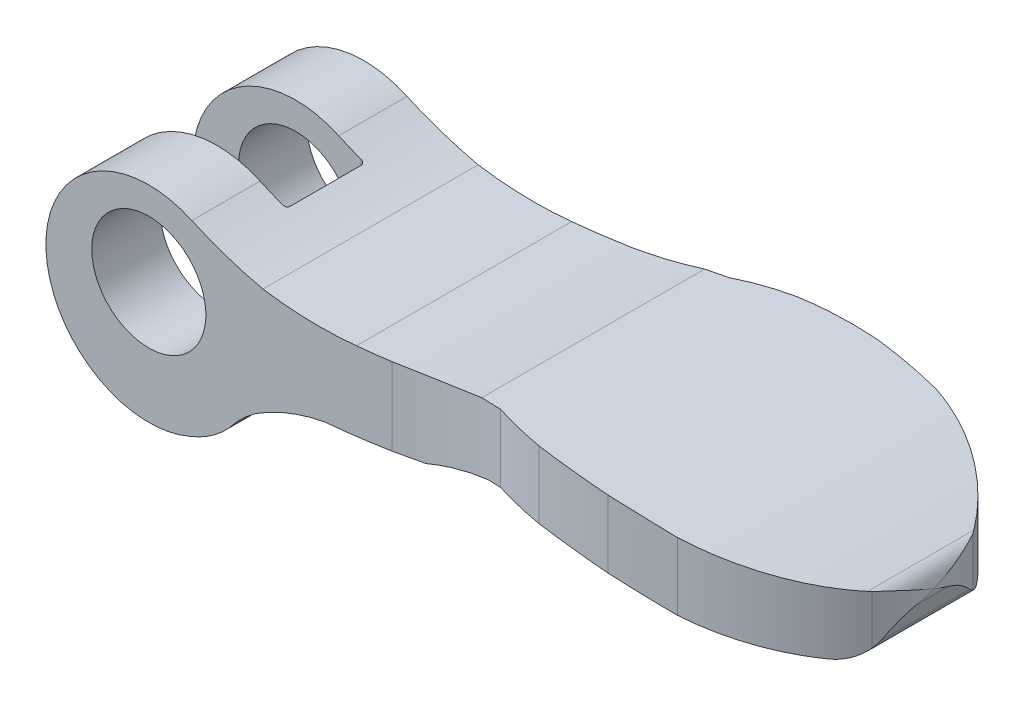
ISO-10303-21;
HEADER;
FILE_DESCRIPTION(('STEP AP214'),'2;1');
FILE_NAME('part.step','',(''),(''),'','','');
FILE_SCHEMA(('AUTOMOTIVE_DESIGN { 1 0 10303 214 1 1 1 1 }'));
ENDSEC;
DATA;
#1=APPLICATION_CONTEXT('core data for automotive mechanical design processes');
#2=APPLICATION_PROTOCOL_DEFINITION('international standard','automotive_design',2000,#1);
#3=PRODUCT_CONTEXT('',#1,'mechanical');
#4=PRODUCT('Part','Part','',(#3));
#5=PRODUCT_RELATED_PRODUCT_CATEGORY('part','',(#4));
#6=PRODUCT_DEFINITION_FORMATION('','',#4);
#7=PRODUCT_DEFINITION_CONTEXT('part definition',#1,'design');
#8=PRODUCT_DEFINITION('design','',#6,#7);
#9=PRODUCT_DEFINITION_SHAPE('','',#8);
#10=(LENGTH_UNIT() NAMED_UNIT(*) SI_UNIT(.MILLI.,.METRE.));
#11=(NAMED_UNIT(*) PLANE_ANGLE_UNIT() SI_UNIT($,.RADIAN.));
#12=(NAMED_UNIT(*) SI_UNIT($,.STERADIAN.) SOLID_ANGLE_UNIT());
#13=UNCERTAINTY_MEASURE_WITH_UNIT(LENGTH_MEASURE(1.E-05),#10,'distance_accuracy_value','');
#14=(GEOMETRIC_REPRESENTATION_CONTEXT(3) GLOBAL_UNCERTAINTY_ASSIGNED_CONTEXT((#13)) GLOBAL_UNIT_ASSIGNED_CONTEXT((#10,
#11,#12)) REPRESENTATION_CONTEXT('',''));
#15=CARTESIAN_POINT('',(0.,0.,0.));
#16=DIRECTION('',(0.,0.,1.));
#17=DIRECTION('',(1.,0.,0.));
#18=AXIS2_PLACEMENT_3D('',#15,#16,#17);
#19=CARTESIAN_POINT('',(3.5,7.5,1.9));
#20=DIRECTION('',(0.,-1.,0.));
#21=DIRECTION('',(0.,0.,-1.));
#22=AXIS2_PLACEMENT_3D('',#19,#20,#21);
#23=CYLINDRICAL_SURFACE('',#22,0.2);
#24=CARTESIAN_POINT('',(3.5,-5.32223928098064,2.1));
#25=CARTESIAN_POINT('',(3.51355837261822,-5.31219074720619,2.09999110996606));
#26=CARTESIAN_POINT('',(3.52707838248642,-5.30206830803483,2.09862027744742));
#27=CARTESIAN_POINT('',(3.55380852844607,-5.28187282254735,2.09311604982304));
#28=CARTESIAN_POINT('',(3.5670139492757,-5.27180139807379,2.08895393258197));
#29=CARTESIAN_POINT('',(3.59280236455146,-5.25195886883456,2.07773231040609));
#30=CARTESIAN_POINT('',(3.60537076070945,-5.24219590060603,2.07062423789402));
#31=CARTESIAN_POINT('',(3.6290737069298,-5.22363557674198,2.05346803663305));
#32=CARTESIAN_POINT('',(3.64021504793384,-5.21483367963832,2.04343463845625));
#33=CARTESIAN_POINT('',(3.65672076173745,-5.20170824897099,2.02463256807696));
#34=CARTESIAN_POINT('',(3.66271173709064,-5.19692083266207,2.01673300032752));
#35=CARTESIAN_POINT('',(3.67361647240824,-5.18817618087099,1.99979259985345));
#36=CARTESIAN_POINT('',(3.67853023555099,-5.18421894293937,1.99075177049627));
#37=CARTESIAN_POINT('',(3.68705030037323,-5.1773397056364,1.97157778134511));
#38=CARTESIAN_POINT('',(3.69064281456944,-5.17442862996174,1.96143445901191));
#39=CARTESIAN_POINT('',(3.6961680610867,-5.16994516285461,1.94043482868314));
#40=CARTESIAN_POINT('',(3.69810588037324,-5.16836866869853,1.92958081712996));
#41=CARTESIAN_POINT('',(3.69942155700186,-5.16729809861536,1.91551811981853));
#42=CARTESIAN_POINT('',(3.69963836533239,-5.16712165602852,1.91241947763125));
#43=CARTESIAN_POINT('',(3.69992736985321,-5.16688644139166,1.90621445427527));
#44=CARTESIAN_POINT('',(3.69999972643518,-5.16682753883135,1.90310808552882));
#45=CARTESIAN_POINT('',(3.7,-5.16682731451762,1.9));
#46=B_SPLINE_CURVE_WITH_KNOTS('',3,(#24,#25,#26,#27,#28,#29,#30,#31,#32,#33,#34,#35,#36,#37,#38,
#39,#40,#41,#42,#43,#44,#45),.UNSPECIFIED.,.F.,.F.,(4,2,2,2,2,2,2,2,2,2,4),(0.,
0.0505967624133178,0.10172231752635,0.153726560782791,0.205473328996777,0.238383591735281,
0.27129375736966,0.304538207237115,0.337680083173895,0.347009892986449,0.356329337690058),.UNSPECIFIED.);
#47=CARTESIAN_POINT('',(3.5,-5.32223928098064,2.1));
#48=VERTEX_POINT('',#47);
#49=CARTESIAN_POINT('',(3.7,-5.16682731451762,1.9));
#50=VERTEX_POINT('',#49);
#51=EDGE_CURVE('E245',#48,#50,#46,.T.);
#52=ORIENTED_EDGE('',*,*,#51,.F.);
#53=DIRECTION('',(0.,1.,0.));
#54=VECTOR('',#53,1.);
#55=CARTESIAN_POINT('',(3.5,7.5,2.1));
#56=LINE('',#55,#54);
#57=CARTESIAN_POINT('',(3.5,3.50301327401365,2.1));
#58=VERTEX_POINT('',#57);
#59=EDGE_CURVE('E241',#48,#58,#56,.T.);
#60=ORIENTED_EDGE('',*,*,#59,.T.);
#61=CARTESIAN_POINT('',(3.7,3.42954611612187,1.9));
#62=CARTESIAN_POINT('',(3.70001152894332,3.42954221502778,1.91076556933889));
#63=CARTESIAN_POINT('',(3.69913155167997,3.42985989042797,1.92152448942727));
#64=CARTESIAN_POINT('',(3.6956780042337,3.43110806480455,1.94270495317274));
#65=CARTESIAN_POINT('',(3.6931084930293,3.43203709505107,1.95312724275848));
#66=CARTESIAN_POINT('',(3.68636482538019,3.43447780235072,1.97336386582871));
#67=CARTESIAN_POINT('',(3.68219081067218,3.43598942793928,1.98317825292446));
#68=CARTESIAN_POINT('',(3.6723907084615,3.43954360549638,2.00194858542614));
#69=CARTESIAN_POINT('',(3.66676421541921,3.44158630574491,2.01090429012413));
#70=CARTESIAN_POINT('',(3.65409150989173,3.44619510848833,2.02795062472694));
#71=CARTESIAN_POINT('',(3.64701401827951,3.44877276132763,2.03601482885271));
#72=CARTESIAN_POINT('',(3.63175181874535,3.45434273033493,2.05084682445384));
#73=CARTESIAN_POINT('',(3.62356684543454,3.45733514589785,2.05761430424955));
#74=CARTESIAN_POINT('',(3.60583360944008,3.46383308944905,2.07006814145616));
#75=CARTESIAN_POINT('',(3.59623444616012,3.46735805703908,2.07567179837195));
#76=CARTESIAN_POINT('',(3.5763292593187,3.47468633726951,2.08519073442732));
#77=CARTESIAN_POINT('',(3.5660230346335,3.47848972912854,2.08910553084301));
#78=CARTESIAN_POINT('',(3.54645495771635,3.48573039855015,2.0947578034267));
#79=CARTESIAN_POINT('',(3.53724938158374,3.4891442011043,2.09672365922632));
#80=CARTESIAN_POINT('',(3.51869508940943,3.49604062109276,2.09934478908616));
#81=CARTESIAN_POINT('',(3.50934661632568,3.49952312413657,2.10000208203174));
#82=CARTESIAN_POINT('',(3.5,3.50301327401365,2.1));
#83=B_SPLINE_CURVE_WITH_KNOTS('',3,(#61,#62,#63,#64,#65,#66,#67,#68,#69,#70,#71,#72,#73,#74,#75,
#76,#77,#78,#79,#80,#81,#82),.UNSPECIFIED.,.F.,.F.,(4,2,2,2,2,2,2,2,2,2,4),(0.,
0.0322458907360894,0.0644145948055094,0.0965804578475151,0.128755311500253,0.161714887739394,
0.194682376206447,0.229512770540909,0.264353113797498,0.294306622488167,0.324213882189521),.UNSPECIFIED.);
#84=CARTESIAN_POINT('',(3.7,3.42954611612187,1.9));
#85=VERTEX_POINT('',#84);
#86=EDGE_CURVE('E18',#85,#58,#83,.T.);
#87=ORIENTED_EDGE('',*,*,#86,.F.);
#88=DIRECTION('',(0.,1.,0.));
#89=VECTOR('',#88,1.);
#90=CARTESIAN_POINT('',(3.7,7.5,1.9));
#91=LINE('',#90,#89);
#92=EDGE_CURVE('E238',#85,#50,#91,.F.);
#93=ORIENTED_EDGE('',*,*,#92,.T.);
#94=EDGE_LOOP('',(#52,#60,#87,#93));
#95=FACE_BOUND('',#94,.T.);
#96=ADVANCED_FACE('F14',(#95),#23,.F.);
#97=CARTESIAN_POINT('',(3.5,7.5,-1.9));
#98=DIRECTION('',(0.,-1.,0.));
#99=DIRECTION('',(0.,0.,-1.));
#100=AXIS2_PLACEMENT_3D('',#97,#98,#99);
#101=CYLINDRICAL_SURFACE('',#100,0.2);
#102=CARTESIAN_POINT('',(3.7,-5.16682731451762,-1.9));
#103=CARTESIAN_POINT('',(3.70001453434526,-5.16681455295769,-1.90951673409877));
#104=CARTESIAN_POINT('',(3.69932178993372,-5.16737938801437,-1.9190148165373));
#105=CARTESIAN_POINT('',(3.69664597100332,-5.16955587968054,-1.93763815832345));
#106=CARTESIAN_POINT('',(3.69467200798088,-5.1711601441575,-1.94676557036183));
#107=CARTESIAN_POINT('',(3.68956003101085,-5.17530565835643,-1.96443577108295));
#108=CARTESIAN_POINT('',(3.6864243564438,-5.1778450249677,-1.9729796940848));
#109=CARTESIAN_POINT('',(3.67915558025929,-5.18371410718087,-1.98935117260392));
#110=CARTESIAN_POINT('',(3.67502066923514,-5.1870452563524,-1.99717739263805));
#111=CARTESIAN_POINT('',(3.66445628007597,-5.1955260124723,-2.01439588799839));
#112=CARTESIAN_POINT('',(3.65771679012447,-5.20091567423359,-2.02347990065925));
#113=CARTESIAN_POINT('',(3.64314114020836,-5.21250735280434,-2.04011923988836));
#114=CARTESIAN_POINT('',(3.63530330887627,-5.21871060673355,-2.04767219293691));
#115=CARTESIAN_POINT('',(3.61675753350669,-5.23329895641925,-2.06292783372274));
#116=CARTESIAN_POINT('',(3.60582076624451,-5.24184282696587,-2.07019992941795));
#117=CARTESIAN_POINT('',(3.58308811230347,-5.25945473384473,-2.08238117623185));
#118=CARTESIAN_POINT('',(3.57129143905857,-5.2685232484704,-2.08728813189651));
#119=CARTESIAN_POINT('',(3.54958122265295,-5.28506893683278,-2.09402029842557));
#120=CARTESIAN_POINT('',(3.53976148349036,-5.29250266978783,-2.09626501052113));
#121=CARTESIAN_POINT('',(3.51996951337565,-5.30738209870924,-2.09925011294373));
#122=CARTESIAN_POINT('',(3.50999809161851,-5.31482761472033,-2.09999675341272));
#123=CARTESIAN_POINT('',(3.5,-5.32223928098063,-2.1));
#124=B_SPLINE_CURVE_WITH_KNOTS('',3,(#102,#103,#104,#105,#106,#107,#108,#109,#110,#111,#112,
#113,#114,#115,#116,#117,#118,#119,#120,#121,#122,#123),.UNSPECIFIED.,.F.,.F.,(4,2,2,2,2,2,2,2,
2,2,4),(0.,0.028478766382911,0.0567571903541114,0.0849789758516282,0.113252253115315,
0.150638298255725,0.188081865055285,0.23484457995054,0.281650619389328,0.319119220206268,
0.356431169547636),.UNSPECIFIED.);
#125=CARTESIAN_POINT('',(3.7,-5.16682731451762,-1.9));
#126=VERTEX_POINT('',#125);
#127=CARTESIAN_POINT('',(3.5,-5.32223928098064,-2.1));
#128=VERTEX_POINT('',#127);
#129=EDGE_CURVE('E769',#126,#128,#124,.T.);
#130=ORIENTED_EDGE('',*,*,#129,.F.);
#131=DIRECTION('',(0.,1.,0.));
#132=VECTOR('',#131,1.);
#133=CARTESIAN_POINT('',(3.7,7.5,-1.9));
#134=LINE('',#133,#132);
#135=CARTESIAN_POINT('',(3.7,3.42954611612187,-1.9));
#136=VERTEX_POINT('',#135);
#137=EDGE_CURVE('E253',#126,#136,#134,.T.);
#138=ORIENTED_EDGE('',*,*,#137,.T.);
#139=CARTESIAN_POINT('',(3.5,3.50301327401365,-2.1));
#140=CARTESIAN_POINT('',(3.5117978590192,3.49860753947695,-2.10000685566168));
#141=CARTESIAN_POINT('',(3.52360265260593,3.49421288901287,-2.09895627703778));
#142=CARTESIAN_POINT('',(3.54690921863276,3.4855605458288,-2.09477976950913));
#143=CARTESIAN_POINT('',(3.55841055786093,3.48130304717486,-2.09165102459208));
#144=CARTESIAN_POINT('',(3.5807732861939,3.47304731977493,-2.08335278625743));
#145=CARTESIAN_POINT('',(3.59163386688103,3.46904941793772,-2.07818077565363));
#146=CARTESIAN_POINT('',(3.61234429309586,3.46144436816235,-2.06590193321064));
#147=CARTESIAN_POINT('',(3.62219493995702,3.45783691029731,-2.05879665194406));
#148=CARTESIAN_POINT('',(3.6402195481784,3.45125006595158,-2.04309541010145));
#149=CARTESIAN_POINT('',(3.64844030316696,3.44825304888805,-2.03456068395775));
#150=CARTESIAN_POINT('',(3.66331598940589,3.44283892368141,-2.01605458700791));
#151=CARTESIAN_POINT('',(3.66997092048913,3.4404218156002,-2.00608321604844));
#152=CARTESIAN_POINT('',(3.68108120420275,3.43639140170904,-1.98565340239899));
#153=CARTESIAN_POINT('',(3.68564669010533,3.43473779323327,-1.97526266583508));
#154=CARTESIAN_POINT('',(3.69296339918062,3.4320895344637,-1.95378926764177));
#155=CARTESIAN_POINT('',(3.69571739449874,3.43109387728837,-1.94270769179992));
#156=CARTESIAN_POINT('',(3.69833814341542,3.43014661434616,-1.92626541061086));
#157=CARTESIAN_POINT('',(3.69896115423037,3.42992147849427,-1.92103031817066));
#158=CARTESIAN_POINT('',(3.69979174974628,3.42962135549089,-1.91053107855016));
#159=CARTESIAN_POINT('',(3.69999996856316,3.4295461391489,-1.90526698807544));
#160=CARTESIAN_POINT('',(3.7,3.42954611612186,-1.9));
#161=B_SPLINE_CURVE_WITH_KNOTS('',3,(#139,#140,#141,#142,#143,#144,#145,#146,#147,#148,#149,
#150,#151,#152,#153,#154,#155,#156,#157,#158,#159,#160),.UNSPECIFIED.,.F.,.F.,(4,2,2,2,2,2,2,2,
2,2,4),(0.,0.0377419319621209,0.0755351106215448,0.11337499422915,0.151184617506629,
0.187664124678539,0.224143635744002,0.258378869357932,0.292561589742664,0.308376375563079,
0.324166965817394),.UNSPECIFIED.);
#162=CARTESIAN_POINT('',(3.5,3.50301327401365,-2.1));
#163=VERTEX_POINT('',#162);
#164=EDGE_CURVE('E259',#163,#136,#161,.T.);
#165=ORIENTED_EDGE('',*,*,#164,.F.);
#166=DIRECTION('',(0.,1.,0.));
#167=VECTOR('',#166,1.);
#168=CARTESIAN_POINT('',(3.5,7.5,-2.1));
#169=LINE('',#168,#167);
#170=EDGE_CURVE('E285',#163,#128,#169,.F.);
#171=ORIENTED_EDGE('',*,*,#170,.T.);
#172=EDGE_LOOP('',(#130,#138,#165,#171));
#173=FACE_BOUND('',#172,.T.);
#174=ADVANCED_FACE('F786',(#173),#101,.F.);
#175=CARTESIAN_POINT('',(3.5,7.5,2.1));
#176=DIRECTION('',(0.,0.,1.));
#177=DIRECTION('',(1.,0.,0.));
#178=AXIS2_PLACEMENT_3D('',#175,#176,#177);
#179=PLANE('',#178);
#180=ORIENTED_EDGE('',*,*,#59,.F.);
#181=CARTESIAN_POINT('',(0.164789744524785,-0.823753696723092,2.1));
#182=DIRECTION('',(0.,0.,-1.));
#183=DIRECTION('',(-1.,0.,0.));
#184=AXIS2_PLACEMENT_3D('',#181,#182,#183);
#185=CIRCLE('',#184,5.6);
#186=CARTESIAN_POINT('',(2.19999999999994,-6.04083326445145,2.1));
#187=VERTEX_POINT('',#186);
#188=EDGE_CURVE('E289',#187,#48,#185,.F.);
#189=ORIENTED_EDGE('',*,*,#188,.F.);
#190=CARTESIAN_POINT('',(0.,-1.,2.1));
#191=DIRECTION('',(0.,0.,-1.));
#192=DIRECTION('',(-1.,0.,0.));
#193=AXIS2_PLACEMENT_3D('',#190,#191,#192);
#194=CIRCLE('',#193,5.5);
#195=CARTESIAN_POINT('',(2.30000000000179,3.9959983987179,2.1));
#196=VERTEX_POINT('',#195);
#197=EDGE_CURVE('E267',#196,#187,#194,.F.);
#198=ORIENTED_EDGE('',*,*,#197,.F.);
#199=CARTESIAN_POINT('',(10.4960669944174,22.2394762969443,2.1));
#200=DIRECTION('',(0.,0.,-1.));
#201=DIRECTION('',(-1.,0.,0.));
#202=AXIS2_PLACEMENT_3D('',#199,#200,#201);
#203=CIRCLE('',#202,20.0000000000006);
#204=EDGE_CURVE('E288',#58,#196,#203,.T.);
#205=ORIENTED_EDGE('',*,*,#204,.F.);
#206=EDGE_LOOP('',(#180,#189,#198,#205));
#207=FACE_BOUND('',#206,.T.);
#208=CARTESIAN_POINT('',(0.,0.,2.1));
#209=DIRECTION('',(0.,0.,-1.));
#210=DIRECTION('',(-1.,0.,0.));
#211=AXIS2_PLACEMENT_3D('',#208,#209,#210);
#212=CIRCLE('',#211,3.05);
#213=CARTESIAN_POINT('',(-3.05,0.,2.1));
#214=VERTEX_POINT('',#213);
#215=EDGE_CURVE('E284',#214,#214,#212,.F.);
#216=ORIENTED_EDGE('',*,*,#215,.T.);
#217=EDGE_LOOP('',(#216));
#218=FACE_BOUND('',#217,.T.);
#219=ADVANCED_FACE('F790',(#207,#218),#179,.F.);
#220=CARTESIAN_POINT('',(-5.5,7.5,-2.1));
#221=DIRECTION('',(0.,0.,-1.));
#222=DIRECTION('',(-1.,0.,0.));
#223=AXIS2_PLACEMENT_3D('',#220,#221,#222);
#224=PLANE('',#223);
#225=CARTESIAN_POINT('',(0.,-1.,-2.1));
#226=DIRECTION('',(0.,0.,-1.));
#227=DIRECTION('',(-1.,0.,0.));
#228=AXIS2_PLACEMENT_3D('',#225,#226,#227);
#229=CIRCLE('',#228,5.5);
#230=CARTESIAN_POINT('',(2.19999999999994,-6.04083326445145,-2.1));
#231=VERTEX_POINT('',#230);
#232=CARTESIAN_POINT('',(2.30000000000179,3.99599839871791,-2.1));
#233=VERTEX_POINT('',#232);
#234=EDGE_CURVE('E279',#231,#233,#229,.T.);
#235=ORIENTED_EDGE('',*,*,#234,.F.);
#236=CARTESIAN_POINT('',(0.164789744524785,-0.823753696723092,-2.1));
#237=DIRECTION('',(0.,0.,-1.));
#238=DIRECTION('',(-1.,0.,0.));
#239=AXIS2_PLACEMENT_3D('',#236,#237,#238);
#240=CIRCLE('',#239,5.6);
#241=EDGE_CURVE('E254',#128,#231,#240,.T.);
#242=ORIENTED_EDGE('',*,*,#241,.F.);
#243=ORIENTED_EDGE('',*,*,#170,.F.);
#244=CARTESIAN_POINT('',(10.4960669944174,22.2394762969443,-2.1));
#245=DIRECTION('',(0.,0.,-1.));
#246=DIRECTION('',(-1.,0.,0.));
#247=AXIS2_PLACEMENT_3D('',#244,#245,#246);
#248=CIRCLE('',#247,20.0000000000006);
#249=EDGE_CURVE('E261',#163,#233,#248,.T.);
#250=ORIENTED_EDGE('',*,*,#249,.T.);
#251=EDGE_LOOP('',(#235,#242,#243,#250));
#252=FACE_BOUND('',#251,.T.);
#253=CARTESIAN_POINT('',(0.,0.,-2.1));
#254=DIRECTION('',(0.,0.,-1.));
#255=DIRECTION('',(-1.,0.,0.));
#256=AXIS2_PLACEMENT_3D('',#253,#254,#255);
#257=CIRCLE('',#256,3.05);
#258=CARTESIAN_POINT('',(-3.05,0.,-2.1));
#259=VERTEX_POINT('',#258);
#260=EDGE_CURVE('E262',#259,#259,#257,.T.);
#261=ORIENTED_EDGE('',*,*,#260,.T.);
#262=EDGE_LOOP('',(#261));
#263=FACE_BOUND('',#262,.T.);
#264=ADVANCED_FACE('F795',(#252,#263),#224,.F.);
#265=CARTESIAN_POINT('',(3.7,7.5,-1.9));
#266=DIRECTION('',(1.,0.,0.));
#267=DIRECTION('',(0.,0.,-1.));
#268=AXIS2_PLACEMENT_3D('',#265,#266,#267);
#269=PLANE('',#268);
#270=ORIENTED_EDGE('',*,*,#137,.F.);
#271=DIRECTION('',(0.,0.,-1.));
#272=VECTOR('',#271,1.);
#273=CARTESIAN_POINT('',(3.7,-5.16682731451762,7.2));
#274=LINE('',#273,#272);
#275=EDGE_CURVE('E252',#50,#126,#274,.T.);
#276=ORIENTED_EDGE('',*,*,#275,.F.);
#277=ORIENTED_EDGE('',*,*,#92,.F.);
#278=DIRECTION('',(0.,0.,-1.));
#279=VECTOR('',#278,1.);
#280=CARTESIAN_POINT('',(3.7,3.42954611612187,7.2));
#281=LINE('',#280,#279);
#282=EDGE_CURVE('E250',#85,#136,#281,.T.);
#283=ORIENTED_EDGE('',*,*,#282,.T.);
#284=EDGE_LOOP('',(#270,#276,#277,#283));
#285=FACE_BOUND('',#284,.T.);
#286=ADVANCED_FACE('F249',(#285),#269,.F.);
#287=CARTESIAN_POINT('',(0.,0.,7.2));
#288=DIRECTION('',(0.,0.,-1.));
#289=DIRECTION('',(-1.,0.,0.));
#290=AXIS2_PLACEMENT_3D('',#287,#288,#289);
#291=CYLINDRICAL_SURFACE('',#290,3.05);
#292=CARTESIAN_POINT('',(0.,0.,5.75));
#293=DIRECTION('',(0.,0.,-1.));
#294=DIRECTION('',(-1.,0.,0.));
#295=AXIS2_PLACEMENT_3D('',#292,#293,#294);
#296=CIRCLE('',#295,3.05);
#297=CARTESIAN_POINT('',(-3.05,0.,5.75));
#298=VERTEX_POINT('',#297);
#299=EDGE_CURVE('E1119',#298,#298,#296,.F.);
#300=ORIENTED_EDGE('',*,*,#299,.T.);
#301=EDGE_LOOP('',(#300));
#302=FACE_BOUND('',#301,.T.);
#303=ORIENTED_EDGE('',*,*,#215,.F.);
#304=EDGE_LOOP('',(#303));
#305=FACE_BOUND('',#304,.T.);
#306=ADVANCED_FACE('F802',(#302,#305),#291,.F.);
#307=CARTESIAN_POINT('',(0.,-1.,7.2));
#308=DIRECTION('',(0.,0.,-1.));
#309=DIRECTION('',(-1.,0.,0.));
#310=AXIS2_PLACEMENT_3D('',#307,#308,#309);
#311=CYLINDRICAL_SURFACE('',#310,5.5);
#312=ORIENTED_EDGE('',*,*,#197,.T.);
#313=DIRECTION('',(0.,0.,-1.));
#314=VECTOR('',#313,1.);
#315=CARTESIAN_POINT('',(2.2,-6.04083326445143,7.2));
#316=LINE('',#315,#314);
#317=CARTESIAN_POINT('',(2.19999999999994,-6.04083326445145,5.75));
#318=VERTEX_POINT('',#317);
#319=EDGE_CURVE('E280',#318,#187,#316,.T.);
#320=ORIENTED_EDGE('',*,*,#319,.F.);
#321=CARTESIAN_POINT('',(0.,-1.,5.75));
#322=DIRECTION('',(0.,0.,-1.));
#323=DIRECTION('',(-1.,0.,0.));
#324=AXIS2_PLACEMENT_3D('',#321,#322,#323);
#325=CIRCLE('',#324,5.5);
#326=CARTESIAN_POINT('',(2.30000000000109,3.99599839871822,5.75));
#327=VERTEX_POINT('',#326);
#328=EDGE_CURVE('E1105',#318,#327,#325,.T.);
#329=ORIENTED_EDGE('',*,*,#328,.T.);
#330=DIRECTION('',(0.,0.,-1.));
#331=VECTOR('',#330,1.);
#332=CARTESIAN_POINT('',(2.30000000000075,3.99599839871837,7.2));
#333=LINE('',#332,#331);
#334=EDGE_CURVE('E264',#327,#196,#333,.T.);
#335=ORIENTED_EDGE('',*,*,#334,.T.);
#336=EDGE_LOOP('',(#312,#320,#329,#335));
#337=FACE_BOUND('',#336,.T.);
#338=ADVANCED_FACE('F805',(#337),#311,.T.);
#339=CARTESIAN_POINT('',(0.,0.,7.2));
#340=DIRECTION('',(0.,0.,-1.));
#341=DIRECTION('',(-1.,0.,0.));
#342=AXIS2_PLACEMENT_3D('',#339,#340,#341);
#343=CYLINDRICAL_SURFACE('',#342,3.05);
#344=CARTESIAN_POINT('',(0.,0.,-5.75));
#345=DIRECTION('',(0.,0.,-1.));
#346=DIRECTION('',(-1.,0.,0.));
#347=AXIS2_PLACEMENT_3D('',#344,#345,#346);
#348=CIRCLE('',#347,3.05);
#349=CARTESIAN_POINT('',(-3.05,0.,-5.75));
#350=VERTEX_POINT('',#349);
#351=EDGE_CURVE('E275',#350,#350,#348,.T.);
#352=ORIENTED_EDGE('',*,*,#351,.T.);
#353=EDGE_LOOP('',(#352));
#354=FACE_BOUND('',#353,.T.);
#355=ORIENTED_EDGE('',*,*,#260,.F.);
#356=EDGE_LOOP('',(#355));
#357=FACE_BOUND('',#356,.T.);
#358=ADVANCED_FACE('F808',(#354,#357),#343,.F.);
#359=CARTESIAN_POINT('',(10.4960669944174,22.2394762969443,7.2));
#360=DIRECTION('',(0.,0.,-1.));
#361=DIRECTION('',(-1.,0.,0.));
#362=AXIS2_PLACEMENT_3D('',#359,#360,#361);
#363=CYLINDRICAL_SURFACE('',#362,20.0000000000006);
#364=ORIENTED_EDGE('',*,*,#334,.F.);
#365=CARTESIAN_POINT('',(10.4960669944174,22.2394762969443,5.75));
#366=DIRECTION('',(0.,0.,-1.));
#367=DIRECTION('',(-1.,0.,0.));
#368=AXIS2_PLACEMENT_3D('',#365,#366,#367);
#369=CIRCLE('',#368,20.0000000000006);
#370=CARTESIAN_POINT('',(6.09999999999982,2.72859228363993,5.75));
#371=VERTEX_POINT('',#370);
#372=EDGE_CURVE('E1103',#327,#371,#369,.F.);
#373=ORIENTED_EDGE('',*,*,#372,.T.);
#374=DIRECTION('',(0.,0.,-1.));
#375=VECTOR('',#374,1.);
#376=CARTESIAN_POINT('',(6.09999999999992,2.72859228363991,7.2));
#377=LINE('',#376,#375);
#378=CARTESIAN_POINT('',(6.09999999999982,2.72859228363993,-5.75));
#379=VERTEX_POINT('',#378);
#380=EDGE_CURVE('E273',#371,#379,#377,.T.);
#381=ORIENTED_EDGE('',*,*,#380,.T.);
#382=CARTESIAN_POINT('',(10.4960669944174,22.2394762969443,-5.75));
#383=DIRECTION('',(0.,0.,-1.));
#384=DIRECTION('',(-1.,0.,0.));
#385=AXIS2_PLACEMENT_3D('',#382,#383,#384);
#386=CIRCLE('',#385,20.0000000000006);
#387=CARTESIAN_POINT('',(2.30000000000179,3.99599839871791,-5.75));
#388=VERTEX_POINT('',#387);
#389=EDGE_CURVE('E1087',#379,#388,#386,.T.);
#390=ORIENTED_EDGE('',*,*,#389,.T.);
#391=DIRECTION('',(0.,0.,-1.));
#392=VECTOR('',#391,1.);
#393=CARTESIAN_POINT('',(2.30000000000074,3.99599839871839,7.2));
#394=LINE('',#393,#392);
#395=EDGE_CURVE('E271',#233,#388,#394,.T.);
#396=ORIENTED_EDGE('',*,*,#395,.F.);
#397=ORIENTED_EDGE('',*,*,#249,.F.);
#398=ORIENTED_EDGE('',*,*,#164,.T.);
#399=ORIENTED_EDGE('',*,*,#282,.F.);
#400=ORIENTED_EDGE('',*,*,#86,.T.);
#401=ORIENTED_EDGE('',*,*,#204,.T.);
#402=EDGE_LOOP('',(#364,#373,#381,#390,#396,#397,#398,#399,#400,#401));
#403=FACE_BOUND('',#402,.T.);
#404=ADVANCED_FACE('F257',(#403),#363,.F.);
#405=CARTESIAN_POINT('',(0.,-1.,7.2));
#406=DIRECTION('',(0.,0.,-1.));
#407=DIRECTION('',(-1.,0.,0.));
#408=AXIS2_PLACEMENT_3D('',#405,#406,#407);
#409=CYLINDRICAL_SURFACE('',#408,5.5);
#410=ORIENTED_EDGE('',*,*,#395,.T.);
#411=CARTESIAN_POINT('',(0.,-1.,-5.75));
#412=DIRECTION('',(0.,0.,-1.));
#413=DIRECTION('',(-1.,0.,0.));
#414=AXIS2_PLACEMENT_3D('',#411,#412,#413);
#415=CIRCLE('',#414,5.5);
#416=CARTESIAN_POINT('',(2.19999999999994,-6.04083326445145,-5.75));
#417=VERTEX_POINT('',#416);
#418=EDGE_CURVE('E1081',#388,#417,#415,.F.);
#419=ORIENTED_EDGE('',*,*,#418,.T.);
#420=DIRECTION('',(0.,0.,-1.));
#421=VECTOR('',#420,1.);
#422=CARTESIAN_POINT('',(2.2,-6.04083326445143,7.2));
#423=LINE('',#422,#421);
#424=EDGE_CURVE('E1138',#231,#417,#423,.T.);
#425=ORIENTED_EDGE('',*,*,#424,.F.);
#426=ORIENTED_EDGE('',*,*,#234,.T.);
#427=EDGE_LOOP('',(#410,#419,#425,#426));
#428=FACE_BOUND('',#427,.T.);
#429=ADVANCED_FACE('F765',(#428),#409,.T.);
#430=CARTESIAN_POINT('',(0.164789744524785,-0.823753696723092,7.2));
#431=DIRECTION('',(0.,0.,-1.));
#432=DIRECTION('',(-1.,0.,0.));
#433=AXIS2_PLACEMENT_3D('',#430,#431,#432);
#434=CYLINDRICAL_SURFACE('',#433,5.6);
#435=DIRECTION('',(0.,0.,-1.));
#436=VECTOR('',#435,1.);
#437=CARTESIAN_POINT('',(4.3,-4.6,7.2));
#438=LINE('',#437,#436);
#439=CARTESIAN_POINT('',(4.29999999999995,-4.60000000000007,-5.75));
#440=VERTEX_POINT('',#439);
#441=CARTESIAN_POINT('',(4.29999999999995,-4.60000000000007,5.75));
#442=VERTEX_POINT('',#441);
#443=EDGE_CURVE('E1139',#440,#442,#438,.F.);
#444=ORIENTED_EDGE('',*,*,#443,.T.);
#445=CARTESIAN_POINT('',(0.164789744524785,-0.823753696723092,5.75));
#446=DIRECTION('',(0.,0.,-1.));
#447=DIRECTION('',(-1.,0.,0.));
#448=AXIS2_PLACEMENT_3D('',#445,#446,#447);
#449=CIRCLE('',#448,5.6);
#450=EDGE_CURVE('E1107',#442,#318,#449,.T.);
#451=ORIENTED_EDGE('',*,*,#450,.T.);
#452=ORIENTED_EDGE('',*,*,#319,.T.);
#453=ORIENTED_EDGE('',*,*,#188,.T.);
#454=ORIENTED_EDGE('',*,*,#51,.T.);
#455=ORIENTED_EDGE('',*,*,#275,.T.);
#456=ORIENTED_EDGE('',*,*,#129,.T.);
#457=ORIENTED_EDGE('',*,*,#241,.T.);
#458=ORIENTED_EDGE('',*,*,#424,.T.);
#459=CARTESIAN_POINT('',(0.164789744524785,-0.823753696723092,-5.75));
#460=DIRECTION('',(0.,0.,-1.));
#461=DIRECTION('',(-1.,0.,0.));
#462=AXIS2_PLACEMENT_3D('',#459,#460,#461);
#463=CIRCLE('',#462,5.6);
#464=EDGE_CURVE('E1089',#417,#440,#463,.F.);
#465=ORIENTED_EDGE('',*,*,#464,.T.);
#466=EDGE_LOOP('',(#444,#451,#452,#453,#454,#455,#456,#457,#458,#465));
#467=FACE_BOUND('',#466,.T.);
#468=ADVANCED_FACE('F760',(#467),#434,.T.);
#469=CARTESIAN_POINT('',(9.41307024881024,-8.44922234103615,7.2));
#470=DIRECTION('',(0.,0.,-1.));
#471=DIRECTION('',(-1.,0.,0.));
#472=AXIS2_PLACEMENT_3D('',#469,#470,#471);
#473=CYLINDRICAL_SURFACE('',#472,6.4);
#474=DIRECTION('',(0.,0.,-1.));
#475=VECTOR('',#474,1.);
#476=CARTESIAN_POINT('',(5.7,-3.23643907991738,7.2));
#477=LINE('',#476,#475);
#478=CARTESIAN_POINT('',(5.69999999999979,-3.2364390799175,-5.75));
#479=VERTEX_POINT('',#478);
#480=CARTESIAN_POINT('',(5.69999999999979,-3.2364390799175,5.75));
#481=VERTEX_POINT('',#480);
#482=EDGE_CURVE('E1140',#479,#481,#477,.F.);
#483=ORIENTED_EDGE('',*,*,#482,.T.);
#484=CARTESIAN_POINT('',(9.41307024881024,-8.44922234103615,5.75));
#485=DIRECTION('',(0.,0.,-1.));
#486=DIRECTION('',(-1.,0.,0.));
#487=AXIS2_PLACEMENT_3D('',#484,#485,#486);
#488=CIRCLE('',#487,6.4);
#489=EDGE_CURVE('E1110',#481,#442,#488,.F.);
#490=ORIENTED_EDGE('',*,*,#489,.T.);
#491=ORIENTED_EDGE('',*,*,#443,.F.);
#492=CARTESIAN_POINT('',(9.41307024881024,-8.44922234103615,-5.75));
#493=DIRECTION('',(0.,0.,-1.));
#494=DIRECTION('',(-1.,0.,0.));
#495=AXIS2_PLACEMENT_3D('',#492,#493,#494);
#496=CIRCLE('',#495,6.4);
#497=EDGE_CURVE('E1091',#440,#479,#496,.T.);
#498=ORIENTED_EDGE('',*,*,#497,.T.);
#499=EDGE_LOOP('',(#483,#490,#491,#498));
#500=FACE_BOUND('',#499,.T.);
#501=ADVANCED_FACE('F756',(#500),#473,.F.);
#502=CARTESIAN_POINT('',(11.3,-12.,7.2));
#503=DIRECTION('',(0.,0.,-1.));
#504=DIRECTION('',(-1.,0.,0.));
#505=AXIS2_PLACEMENT_3D('',#502,#503,#504);
#506=CYLINDRICAL_SURFACE('',#505,10.4);
#507=DIRECTION('',(0.,0.,-1.));
#508=VECTOR('',#507,1.);
#509=CARTESIAN_POINT('',(9.40000000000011,-1.77503056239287,7.2));
#510=LINE('',#509,#508);
#511=CARTESIAN_POINT('',(9.4,-1.77503056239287,5.75));
#512=VERTEX_POINT('',#511);
#513=CARTESIAN_POINT('',(9.4,-1.77503056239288,-5.75));
#514=VERTEX_POINT('',#513);
#515=EDGE_CURVE('E1146',#512,#514,#510,.T.);
#516=ORIENTED_EDGE('',*,*,#515,.F.);
#517=CARTESIAN_POINT('',(11.3,-12.,5.75));
#518=DIRECTION('',(0.,0.,-1.));
#519=DIRECTION('',(-1.,0.,0.));
#520=AXIS2_PLACEMENT_3D('',#517,#518,#519);
#521=CIRCLE('',#520,10.4);
#522=EDGE_CURVE('E1113',#512,#481,#521,.F.);
#523=ORIENTED_EDGE('',*,*,#522,.T.);
#524=ORIENTED_EDGE('',*,*,#482,.F.);
#525=CARTESIAN_POINT('',(11.3,-12.,-5.75));
#526=DIRECTION('',(0.,0.,-1.));
#527=DIRECTION('',(-1.,0.,0.));
#528=AXIS2_PLACEMENT_3D('',#525,#526,#527);
#529=CIRCLE('',#528,10.4);
#530=EDGE_CURVE('E1175',#479,#514,#529,.T.);
#531=ORIENTED_EDGE('',*,*,#530,.T.);
#532=EDGE_LOOP('',(#516,#523,#524,#531));
#533=FACE_BOUND('',#532,.T.);
#534=ADVANCED_FACE('F752',(#533),#506,.F.);
#535=CARTESIAN_POINT('',(35.2,1.0310310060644,7.2));
#536=DIRECTION('',(0.,0.,-1.));
#537=DIRECTION('',(-1.,0.,0.));
#538=AXIS2_PLACEMENT_3D('',#535,#536,#537);
#539=CYLINDRICAL_SURFACE('',#538,1.00000000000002);
#540=CARTESIAN_POINT('',(36.2,1.03103100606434,1.03278233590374E-11));
#541=CARTESIAN_POINT('',(36.2000000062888,1.03071830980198,1.6226000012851E-06));
#542=CARTESIAN_POINT('',(36.1999998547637,1.03040815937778,-3.4033014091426E-05));
#543=CARTESIAN_POINT('',(36.1999992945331,1.02980716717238,-0.000164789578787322));
#544=CARTESIAN_POINT('',(36.1999988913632,1.02951605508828,-0.000258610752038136));
#545=CARTESIAN_POINT('',(36.1999977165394,1.02886115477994,-0.000529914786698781));
#546=CARTESIAN_POINT('',(36.1999968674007,1.02850484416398,-0.000724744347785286));
#547=CARTESIAN_POINT('',(36.1999949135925,1.02782341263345,-0.00116716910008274));
#548=CARTESIAN_POINT('',(36.1999938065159,1.02749862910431,-0.00141525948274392));
#549=CARTESIAN_POINT('',(36.1999892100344,1.02629970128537,-0.00242950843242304));
#550=CARTESIAN_POINT('',(36.1999851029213,1.02552105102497,-0.00330485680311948));
#551=CARTESIAN_POINT('',(36.1999760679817,1.02407838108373,-0.00514281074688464));
#552=CARTESIAN_POINT('',(36.1999711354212,1.02341507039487,-0.00610590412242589));
#553=CARTESIAN_POINT('',(36.1999183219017,1.0169355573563,-0.0159354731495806));
#554=CARTESIAN_POINT('',(36.1998454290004,1.01278643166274,-0.0257881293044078));
#555=CARTESIAN_POINT('',(36.1993713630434,0.99234661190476,-0.074755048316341));
#556=CARTESIAN_POINT('',(36.1986385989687,0.976644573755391,-0.113749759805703));
#557=CARTESIAN_POINT('',(36.1953704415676,0.929898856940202,-0.231076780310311));
#558=CARTESIAN_POINT('',(36.191765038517,0.89922247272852,-0.309735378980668));
#559=CARTESIAN_POINT('',(36.1816956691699,0.838104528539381,-0.466837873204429));
#560=CARTESIAN_POINT('',(36.1752307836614,0.807663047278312,-0.545281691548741));
#561=CARTESIAN_POINT('',(36.1634375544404,0.762655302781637,-0.662338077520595));
#562=CARTESIAN_POINT('',(36.1591976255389,0.747873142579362,-0.700960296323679));
#563=CARTESIAN_POINT('',(36.1500197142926,0.718463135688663,-0.778166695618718));
#564=CARTESIAN_POINT('',(36.1450819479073,0.703835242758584,-0.816750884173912));
#565=CARTESIAN_POINT('',(36.1397934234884,0.689287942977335,-0.855312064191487));
#566=B_SPLINE_CURVE_WITH_KNOTS('',3,(#540,#541,#542,#543,#544,#545,#546,#547,#548,#549,#550,
#551,#552,#553,#554,#555,#556,#557,#558,#559,#560,#561,#562,#563,#564,#565),.UNSPECIFIED.,.F.,
.F.,(4,2,2,2,2,2,2,2,2,2,2,2,4),(0.,0.000931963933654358,0.00184411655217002,0.003055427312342,
0.00427852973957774,0.00776482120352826,0.0112718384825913,0.0431138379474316,0.169653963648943,
0.422788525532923,0.676004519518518,0.800706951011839,0.925370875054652),.UNSPECIFIED.);
#567=CARTESIAN_POINT('',(36.2,1.03103100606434,8.37193334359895E-12));
#568=VERTEX_POINT('',#567);
#569=CARTESIAN_POINT('',(36.1397934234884,0.689287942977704,-0.855312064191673));
#570=VERTEX_POINT('',#569);
#571=EDGE_CURVE('E735',#568,#570,#566,.T.);
#572=ORIENTED_EDGE('',*,*,#571,.F.);
#573=CARTESIAN_POINT('',(36.1397934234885,0.689287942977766,0.855312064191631));
#574=CARTESIAN_POINT('',(36.1533944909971,0.726713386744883,0.756117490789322));
#575=CARTESIAN_POINT('',(36.1646782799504,0.764676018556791,0.656815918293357));
#576=CARTESIAN_POINT('',(36.1795909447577,0.828350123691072,0.491860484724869));
#577=CARTESIAN_POINT('',(36.1845180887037,0.853841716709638,0.426237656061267));
#578=CARTESIAN_POINT('',(36.1910143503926,0.896207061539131,0.317704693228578));
#579=CARTESIAN_POINT('',(36.1931554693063,0.913007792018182,0.274799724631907));
#580=CARTESIAN_POINT('',(36.1959835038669,0.940820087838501,0.204064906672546));
#581=CARTESIAN_POINT('',(36.1969170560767,0.951793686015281,0.176229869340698));
#582=CARTESIAN_POINT('',(36.1981588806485,0.969957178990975,0.13042952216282));
#583=CARTESIAN_POINT('',(36.1985715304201,0.977113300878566,0.112453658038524));
#584=CARTESIAN_POINT('',(36.1991273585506,0.989002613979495,0.082909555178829));
#585=CARTESIAN_POINT('',(36.1993142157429,0.993696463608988,0.0713263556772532));
#586=CARTESIAN_POINT('',(36.1995703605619,1.00155786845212,0.0523083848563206));
#587=CARTESIAN_POINT('',(36.1996578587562,1.00467839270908,0.0448546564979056));
#588=CARTESIAN_POINT('',(36.1997804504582,1.00997367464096,0.0326342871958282));
#589=CARTESIAN_POINT('',(36.1998231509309,1.01209495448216,0.027844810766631));
#590=CARTESIAN_POINT('',(36.1998844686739,1.01576152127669,0.0200087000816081));
#591=CARTESIAN_POINT('',(36.1999062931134,1.01724994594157,0.0169363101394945));
#592=CARTESIAN_POINT('',(36.1999384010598,1.01988240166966,0.0119291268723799));
#593=CARTESIAN_POINT('',(36.1999500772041,1.02096978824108,0.00996511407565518));
#594=CARTESIAN_POINT('',(36.1999676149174,1.02294370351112,0.00678217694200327));
#595=CARTESIAN_POINT('',(36.1999741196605,1.02377698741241,0.00553244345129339));
#596=CARTESIAN_POINT('',(36.199982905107,1.02516569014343,0.00375472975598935));
#597=CARTESIAN_POINT('',(36.1999856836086,1.02565465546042,0.00317552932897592));
#598=CARTESIAN_POINT('',(36.1999907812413,1.02670476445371,0.0020850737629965));
#599=CARTESIAN_POINT('',(36.1999931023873,1.02726557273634,0.00157352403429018));
#600=CARTESIAN_POINT('',(36.199995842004,1.028136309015,0.000957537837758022));
#601=CARTESIAN_POINT('',(36.1999965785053,1.02840074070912,0.000790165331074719));
#602=CARTESIAN_POINT('',(36.1999978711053,1.0289494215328,0.000494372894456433));
#603=CARTESIAN_POINT('',(36.1999984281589,1.02923355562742,0.000365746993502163));
#604=CARTESIAN_POINT('',(36.1999992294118,1.02976692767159,0.000179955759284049));
#605=CARTESIAN_POINT('',(36.1999995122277,1.03001302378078,0.000114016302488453));
#606=CARTESIAN_POINT('',(36.1999999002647,1.03051598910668,2.33543787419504E-05));
#607=CARTESIAN_POINT('',(36.2000000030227,1.03077295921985,-7.96392284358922E-07));
#608=CARTESIAN_POINT('',(36.2,1.03103100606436,6.41604332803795E-12));
#609=B_SPLINE_CURVE_WITH_KNOTS('',3,(#573,#574,#575,#576,#577,#578,#579,#580,#581,#582,#583,
#584,#585,#586,#587,#588,#589,#590,#591,#592,#593,#594,#595,#596,#597,#598,#599,#600,#601,#602,
#603,#604,#605,#606,#607,#608),.UNSPECIFIED.,.F.,.F.,(4,2,2,2,2,2,2,2,2,2,2,2,2,2,2,2,2,4),(0.,
0.320624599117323,0.532312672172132,0.670685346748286,0.760486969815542,0.818543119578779,
0.856041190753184,0.880283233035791,0.895997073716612,0.906235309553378,0.912966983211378,
0.917462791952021,0.91973464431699,0.921996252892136,0.922932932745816,0.923864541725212,
0.924625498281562,0.925396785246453),.UNSPECIFIED.);
#610=CARTESIAN_POINT('',(36.1397934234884,0.689287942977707,0.855312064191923));
#611=VERTEX_POINT('',#610);
#612=EDGE_CURVE('E733',#611,#568,#609,.T.);
#613=ORIENTED_EDGE('',*,*,#612,.F.);
#614=DIRECTION('',(0.,0.,1.));
#615=VECTOR('',#614,1.);
#616=CARTESIAN_POINT('',(36.1397934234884,0.689287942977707,7.2));
#617=LINE('',#616,#615);
#618=EDGE_CURVE('E1145',#611,#570,#617,.F.);
#619=ORIENTED_EDGE('',*,*,#618,.T.);
#620=EDGE_LOOP('',(#572,#613,#619));
#621=FACE_BOUND('',#620,.T.);
#622=ADVANCED_FACE('F747',(#621),#539,.T.);
#623=CARTESIAN_POINT('',(35.7397934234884,-0.410712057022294,7.2));
#624=DIRECTION('',(-0.939793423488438,0.341743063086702,0.));
#625=DIRECTION('',(-0.341743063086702,-0.939793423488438,0.));
#626=AXIS2_PLACEMENT_3D('',#623,#624,#625);
#627=PLANE('',#626);
#628=CARTESIAN_POINT('',(29.7000592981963,-17.0199809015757,0.0277646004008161));
#629=DIRECTION('',(-0.939793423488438,0.341743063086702,0.));
#630=DIRECTION('',(-0.341743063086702,-0.939793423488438,0.));
#631=AXIS2_PLACEMENT_3D('',#628,#629,#630);
#632=ELLIPSE('',#631,19.0201373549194,6.5);
#633=CARTESIAN_POINT('',(35.7397934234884,-0.410712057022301,-2.37465328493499));
#634=VERTEX_POINT('',#633);
#635=EDGE_CURVE('E736',#570,#634,#632,.T.);
#636=ORIENTED_EDGE('',*,*,#635,.F.);
#637=ORIENTED_EDGE('',*,*,#618,.F.);
#638=CARTESIAN_POINT('',(29.7000592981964,-17.0199809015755,-0.0277646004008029));
#639=DIRECTION('',(-0.939793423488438,0.341743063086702,0.));
#640=DIRECTION('',(-0.341743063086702,-0.939793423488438,0.));
#641=AXIS2_PLACEMENT_3D('',#638,#639,#640);
#642=ELLIPSE('',#641,19.0201373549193,6.49999999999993);
#643=CARTESIAN_POINT('',(35.7397934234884,-0.410712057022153,2.37465328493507));
#644=VERTEX_POINT('',#643);
#645=EDGE_CURVE('E431',#644,#611,#642,.T.);
#646=ORIENTED_EDGE('',*,*,#645,.F.);
#647=DIRECTION('',(0.,0.,-1.));
#648=VECTOR('',#647,1.);
#649=CARTESIAN_POINT('',(35.7397934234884,-0.410712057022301,7.2));
#650=LINE('',#649,#648);
#651=EDGE_CURVE('E384',#634,#644,#650,.F.);
#652=ORIENTED_EDGE('',*,*,#651,.F.);
#653=EDGE_LOOP('',(#636,#637,#646,#652));
#654=FACE_BOUND('',#653,.T.);
#655=ADVANCED_FACE('F751',(#654),#627,.F.);
#656=CARTESIAN_POINT('',(4.96447479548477,48.3290223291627,7.2));
#657=DIRECTION('',(0.,0.,-1.));
#658=DIRECTION('',(-1.,0.,0.));
#659=AXIS2_PLACEMENT_3D('',#656,#657,#658);
#660=CYLINDRICAL_SURFACE('',#659,50.2999999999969);
#661=CARTESIAN_POINT('',(14.8,-1.00000000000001,5.74607178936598));
#662=CARTESIAN_POINT('',(14.7250413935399,-1.01494572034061,5.74441159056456));
#663=CARTESIAN_POINT('',(14.6500438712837,-1.02972153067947,5.74297848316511));
#664=CARTESIAN_POINT('',(14.5000444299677,-1.05891895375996,5.74056885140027));
#665=CARTESIAN_POINT('',(14.4250425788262,-1.07334088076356,5.73959190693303));
#666=CARTESIAN_POINT('',(14.2750361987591,-1.1018310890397,5.73809459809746));
#667=CARTESIAN_POINT('',(14.2000317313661,-1.11589967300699,5.73757382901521));
#668=CARTESIAN_POINT('',(14.0500218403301,-1.14368376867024,5.7369888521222));
#669=CARTESIAN_POINT('',(13.9750164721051,-1.15739957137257,5.73692425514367));
#670=CARTESIAN_POINT('',(13.8250064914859,-1.18447868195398,5.73725160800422));
#671=CARTESIAN_POINT('',(13.7500019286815,-1.19784226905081,5.73764318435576));
#672=CARTESIAN_POINT('',(13.5999952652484,-1.22421753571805,5.73888286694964));
#673=CARTESIAN_POINT('',(13.5249932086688,-1.2372294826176,5.73973061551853));
#674=CARTESIAN_POINT('',(13.3749932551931,-1.2629020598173,5.7418826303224));
#675=CARTESIAN_POINT('',(13.2999953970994,-1.27556294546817,5.7431865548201));
#676=CARTESIAN_POINT('',(13.1500055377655,-1.30053401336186,5.74625089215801));
#677=CARTESIAN_POINT('',(13.0750135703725,-1.31284443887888,5.74801097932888));
#678=CARTESIAN_POINT('',(12.9999999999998,-1.32498390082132,5.75));
#679=B_SPLINE_CURVE_WITH_KNOTS('',3,(#661,#662,#663,#664,#665,#666,#667,#668,#669,#670,#671,
#672,#673,#674,#675,#676,#677,#678),.UNSPECIFIED.,.F.,.F.,(4,2,2,2,2,2,2,2,4),(0.,
0.229355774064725,0.458499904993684,0.687440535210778,0.916185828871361,1.14474397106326,
1.37312316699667,1.60133164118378,1.82937763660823),.UNSPECIFIED.);
#680=CARTESIAN_POINT('',(14.8,-1.,5.74607178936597));
#681=VERTEX_POINT('',#680);
#682=CARTESIAN_POINT('',(12.9999999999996,-1.32498390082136,5.75));
#683=VERTEX_POINT('',#682);
#684=EDGE_CURVE('E429',#681,#683,#679,.T.);
#685=ORIENTED_EDGE('',*,*,#684,.T.);
#686=CARTESIAN_POINT('',(4.96447479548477,48.3290223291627,5.75));
#687=DIRECTION('',(0.,0.,-1.));
#688=DIRECTION('',(-1.,0.,0.));
#689=AXIS2_PLACEMENT_3D('',#686,#687,#688);
#690=CIRCLE('',#689,50.2999999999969);
#691=EDGE_CURVE('E1116',#683,#512,#690,.T.);
#692=ORIENTED_EDGE('',*,*,#691,.T.);
#693=ORIENTED_EDGE('',*,*,#515,.T.);
#694=CARTESIAN_POINT('',(4.96447479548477,48.3290223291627,-5.75));
#695=DIRECTION('',(0.,0.,-1.));
#696=DIRECTION('',(-1.,0.,0.));
#697=AXIS2_PLACEMENT_3D('',#694,#695,#696);
#698=CIRCLE('',#697,50.2999999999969);
#699=CARTESIAN_POINT('',(12.9999999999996,-1.32498390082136,-5.75));
#700=VERTEX_POINT('',#699);
#701=EDGE_CURVE('E433',#514,#700,#698,.F.);
#702=ORIENTED_EDGE('',*,*,#701,.T.);
#703=CARTESIAN_POINT('',(12.9999999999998,-1.32498390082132,-5.75));
#704=CARTESIAN_POINT('',(13.0750135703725,-1.31284443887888,-5.74801097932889));
#705=CARTESIAN_POINT('',(13.1500055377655,-1.30053401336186,-5.74625089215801));
#706=CARTESIAN_POINT('',(13.2999953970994,-1.27556294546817,-5.74318655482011));
#707=CARTESIAN_POINT('',(13.3749932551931,-1.2629020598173,-5.7418826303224));
#708=CARTESIAN_POINT('',(13.5249932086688,-1.2372294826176,-5.73973061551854));
#709=CARTESIAN_POINT('',(13.5999952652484,-1.22421753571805,-5.73888286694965));
#710=CARTESIAN_POINT('',(13.7500019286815,-1.19784226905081,-5.73764318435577));
#711=CARTESIAN_POINT('',(13.8250064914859,-1.18447868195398,-5.73725160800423));
#712=CARTESIAN_POINT('',(13.9750164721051,-1.15739957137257,-5.73692425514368));
#713=CARTESIAN_POINT('',(14.0500218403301,-1.14368376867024,-5.73698885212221));
#714=CARTESIAN_POINT('',(14.2000317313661,-1.11589967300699,-5.73757382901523));
#715=CARTESIAN_POINT('',(14.2750361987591,-1.1018310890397,-5.73809459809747));
#716=CARTESIAN_POINT('',(14.4250425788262,-1.07334088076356,-5.73959190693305));
#717=CARTESIAN_POINT('',(14.5000444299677,-1.05891895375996,-5.74056885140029));
#718=CARTESIAN_POINT('',(14.6500438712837,-1.02972153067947,-5.74297848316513));
#719=CARTESIAN_POINT('',(14.7250413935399,-1.01494572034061,-5.74441159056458));
#720=CARTESIAN_POINT('',(14.8,-1.00000000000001,-5.746071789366));
#721=B_SPLINE_CURVE_WITH_KNOTS('',3,(#703,#704,#705,#706,#707,#708,#709,#710,#711,#712,#713,
#714,#715,#716,#717,#718,#719,#720),.UNSPECIFIED.,.F.,.F.,(4,2,2,2,2,2,2,2,4),(0.,
0.228045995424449,0.45625446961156,0.684633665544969,0.913191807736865,1.14193710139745,
1.37087773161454,1.6000218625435,1.82937763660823),.UNSPECIFIED.);
#722=CARTESIAN_POINT('',(14.8,-1.00000000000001,-5.74607178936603));
#723=VERTEX_POINT('',#722);
#724=EDGE_CURVE('E452',#700,#723,#721,.T.);
#725=ORIENTED_EDGE('',*,*,#724,.T.);
#726=DIRECTION('',(0.,0.,-1.));
#727=VECTOR('',#726,1.);
#728=CARTESIAN_POINT('',(14.8,-1.,7.2));
#729=LINE('',#728,#727);
#730=EDGE_CURVE('E1122',#723,#681,#729,.F.);
#731=ORIENTED_EDGE('',*,*,#730,.T.);
#732=EDGE_LOOP('',(#685,#692,#693,#702,#725,#731));
#733=FACE_BOUND('',#732,.T.);
#734=ADVANCED_FACE('F441',(#733),#660,.T.);
#735=CARTESIAN_POINT('',(22.6985500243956,-19.1563462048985,7.2));
#736=DIRECTION('',(0.,0.,-1.));
#737=DIRECTION('',(-1.,0.,0.));
#738=AXIS2_PLACEMENT_3D('',#735,#736,#737);
#739=CYLINDRICAL_SURFACE('',#738,19.8000000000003);
#740=CARTESIAN_POINT('',(14.8,-1.,-5.74607178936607));
#741=CARTESIAN_POINT('',(15.0908549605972,-0.873456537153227,-5.7525032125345));
#742=CARTESIAN_POINT('',(15.3847001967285,-0.753950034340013,-5.76245393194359));
#743=CARTESIAN_POINT('',(15.9766382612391,-0.529599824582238,-5.78969092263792));
#744=CARTESIAN_POINT('',(16.2747165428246,-0.4247151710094,-5.80695613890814));
#745=CARTESIAN_POINT('',(16.8750633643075,-0.229470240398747,-5.84915224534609));
#746=CARTESIAN_POINT('',(17.177331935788,-0.139110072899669,-5.87408319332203));
#747=CARTESIAN_POINT('',(17.7860028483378,0.0271577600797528,-5.93192183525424));
#748=CARTESIAN_POINT('',(18.0924145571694,0.103023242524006,-5.96485219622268));
#749=CARTESIAN_POINT('',(18.4,0.171417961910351,-6.00186733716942));
#750=B_SPLINE_CURVE_WITH_KNOTS('',3,(#740,#741,#742,#743,#744,#745,#746,#747,#748,#749),
.UNSPECIFIED.,.F.,.F.,(4,2,2,2,4),(0.,0.951665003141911,1.90060902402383,2.84956020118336,
3.80123233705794),.UNSPECIFIED.);
#751=CARTESIAN_POINT('',(18.4,0.171417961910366,-6.00186733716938));
#752=VERTEX_POINT('',#751);
#753=EDGE_CURVE('E367',#723,#752,#750,.T.);
#754=ORIENTED_EDGE('',*,*,#753,.T.);
#755=DIRECTION('',(0.,0.,-1.));
#756=VECTOR('',#755,1.);
#757=CARTESIAN_POINT('',(18.4,0.171417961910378,7.2));
#758=LINE('',#757,#756);
#759=CARTESIAN_POINT('',(18.4,0.171417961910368,6.0018673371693));
#760=VERTEX_POINT('',#759);
#761=EDGE_CURVE('E370',#752,#760,#758,.F.);
#762=ORIENTED_EDGE('',*,*,#761,.T.);
#763=CARTESIAN_POINT('',(18.4,0.171417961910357,6.00186733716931));
#764=CARTESIAN_POINT('',(18.0924145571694,0.103023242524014,5.96485219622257));
#765=CARTESIAN_POINT('',(17.7860028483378,0.0271577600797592,5.93192183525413));
#766=CARTESIAN_POINT('',(17.177331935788,-0.139110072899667,5.87408319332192));
#767=CARTESIAN_POINT('',(16.8750633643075,-0.229470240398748,5.84915224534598));
#768=CARTESIAN_POINT('',(16.2747165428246,-0.4247151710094,5.80695613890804));
#769=CARTESIAN_POINT('',(15.9766382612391,-0.529599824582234,5.78969092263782));
#770=CARTESIAN_POINT('',(15.3847001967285,-0.753950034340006,5.76245393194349));
#771=CARTESIAN_POINT('',(15.0908549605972,-0.87345653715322,5.7525032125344));
#772=CARTESIAN_POINT('',(14.8,-1.,5.74607178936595));
#773=B_SPLINE_CURVE_WITH_KNOTS('',3,(#763,#764,#765,#766,#767,#768,#769,#770,#771,#772),
.UNSPECIFIED.,.F.,.F.,(4,2,2,2,4),(0.,0.951672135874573,1.9006233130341,2.84956733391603,
3.80123233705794),.UNSPECIFIED.);
#774=EDGE_CURVE('E420',#760,#681,#773,.T.);
#775=ORIENTED_EDGE('',*,*,#774,.T.);
#776=ORIENTED_EDGE('',*,*,#730,.F.);
#777=EDGE_LOOP('',(#754,#762,#775,#776));
#778=FACE_BOUND('',#777,.T.);
#779=ADVANCED_FACE('F435',(#778),#739,.F.);
#780=CARTESIAN_POINT('',(-5.5,7.5,5.75));
#781=DIRECTION('',(0.,0.,-1.));
#782=DIRECTION('',(-1.,0.,0.));
#783=AXIS2_PLACEMENT_3D('',#780,#781,#782);
#784=PLANE('',#783);
#785=CARTESIAN_POINT('',(9.1,22.2999999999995,5.75));
#786=DIRECTION('',(0.,0.,-1.));
#787=DIRECTION('',(-1.,0.,0.));
#788=AXIS2_PLACEMENT_3D('',#785,#786,#787);
#789=CIRCLE('',#788,19.7999999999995);
#790=CARTESIAN_POINT('',(11.1000000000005,2.60126907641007,5.75));
#791=VERTEX_POINT('',#790);
#792=EDGE_CURVE('E276',#791,#371,#789,.T.);
#793=ORIENTED_EDGE('',*,*,#792,.T.);
#794=ORIENTED_EDGE('',*,*,#372,.F.);
#795=ORIENTED_EDGE('',*,*,#328,.F.);
#796=ORIENTED_EDGE('',*,*,#450,.F.);
#797=ORIENTED_EDGE('',*,*,#489,.F.);
#798=ORIENTED_EDGE('',*,*,#522,.F.);
#799=ORIENTED_EDGE('',*,*,#691,.F.);
#800=DIRECTION('',(0.,-1.,0.));
#801=VECTOR('',#800,1.);
#802=CARTESIAN_POINT('',(12.9999999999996,7.5,5.75));
#803=LINE('',#802,#801);
#804=CARTESIAN_POINT('',(12.9999999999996,2.81815680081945,5.75));
#805=VERTEX_POINT('',#804);
#806=EDGE_CURVE('E391',#683,#805,#803,.F.);
#807=ORIENTED_EDGE('',*,*,#806,.T.);
#808=CARTESIAN_POINT('',(6.41432291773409,52.0798950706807,5.75));
#809=DIRECTION('',(0.,0.,-1.));
#810=DIRECTION('',(-1.,0.,0.));
#811=AXIS2_PLACEMENT_3D('',#808,#809,#810);
#812=CIRCLE('',#811,49.7000000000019);
#813=EDGE_CURVE('E623',#805,#791,#812,.T.);
#814=ORIENTED_EDGE('',*,*,#813,.T.);
#815=EDGE_LOOP('',(#793,#794,#795,#796,#797,#798,#799,#807,#814));
#816=FACE_BOUND('',#815,.T.);
#817=ORIENTED_EDGE('',*,*,#299,.F.);
#818=EDGE_LOOP('',(#817));
#819=FACE_BOUND('',#818,.T.);
#820=ADVANCED_FACE('F440',(#816,#819),#784,.F.);
#821=CARTESIAN_POINT('',(9.1,22.2999999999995,7.2));
#822=DIRECTION('',(0.,0.,-1.));
#823=DIRECTION('',(-1.,0.,0.));
#824=AXIS2_PLACEMENT_3D('',#821,#822,#823);
#825=CYLINDRICAL_SURFACE('',#824,19.7999999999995);
#826=ORIENTED_EDGE('',*,*,#380,.F.);
#827=ORIENTED_EDGE('',*,*,#792,.F.);
#828=DIRECTION('',(0.,0.,-1.));
#829=VECTOR('',#828,1.);
#830=CARTESIAN_POINT('',(11.1000000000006,2.60126907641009,7.2));
#831=LINE('',#830,#829);
#832=CARTESIAN_POINT('',(11.1000000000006,2.60126907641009,-5.75));
#833=VERTEX_POINT('',#832);
#834=EDGE_CURVE('E617',#791,#833,#831,.T.);
#835=ORIENTED_EDGE('',*,*,#834,.T.);
#836=CARTESIAN_POINT('',(9.1,22.2999999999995,-5.75));
#837=DIRECTION('',(0.,0.,-1.));
#838=DIRECTION('',(-1.,0.,0.));
#839=AXIS2_PLACEMENT_3D('',#836,#837,#838);
#840=CIRCLE('',#839,19.7999999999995);
#841=EDGE_CURVE('E1093',#833,#379,#840,.T.);
#842=ORIENTED_EDGE('',*,*,#841,.T.);
#843=EDGE_LOOP('',(#826,#827,#835,#842));
#844=FACE_BOUND('',#843,.T.);
#845=ADVANCED_FACE('F933',(#844),#825,.F.);
#846=CARTESIAN_POINT('',(12.9999999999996,7.5,-5.75));
#847=DIRECTION('',(0.,0.,1.));
#848=DIRECTION('',(1.,0.,0.));
#849=AXIS2_PLACEMENT_3D('',#846,#847,#848);
#850=PLANE('',#849);
#851=DIRECTION('',(0.,-1.,0.));
#852=VECTOR('',#851,1.);
#853=CARTESIAN_POINT('',(12.9999999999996,7.5,-5.75000000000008));
#854=LINE('',#853,#852);
#855=CARTESIAN_POINT('',(12.9999999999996,2.81815680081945,-5.75));
#856=VERTEX_POINT('',#855);
#857=EDGE_CURVE('E368',#856,#700,#854,.T.);
#858=ORIENTED_EDGE('',*,*,#857,.T.);
#859=ORIENTED_EDGE('',*,*,#701,.F.);
#860=ORIENTED_EDGE('',*,*,#530,.F.);
#861=ORIENTED_EDGE('',*,*,#497,.F.);
#862=ORIENTED_EDGE('',*,*,#464,.F.);
#863=ORIENTED_EDGE('',*,*,#418,.F.);
#864=ORIENTED_EDGE('',*,*,#389,.F.);
#865=ORIENTED_EDGE('',*,*,#841,.F.);
#866=CARTESIAN_POINT('',(6.41432291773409,52.0798950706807,-5.75));
#867=DIRECTION('',(0.,0.,-1.));
#868=DIRECTION('',(-1.,0.,0.));
#869=AXIS2_PLACEMENT_3D('',#866,#867,#868);
#870=CIRCLE('',#869,49.7000000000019);
#871=EDGE_CURVE('E612',#833,#856,#870,.F.);
#872=ORIENTED_EDGE('',*,*,#871,.T.);
#873=EDGE_LOOP('',(#858,#859,#860,#861,#862,#863,#864,#865,#872));
#874=FACE_BOUND('',#873,.T.);
#875=ORIENTED_EDGE('',*,*,#351,.F.);
#876=EDGE_LOOP('',(#875));
#877=FACE_BOUND('',#876,.T.);
#878=ADVANCED_FACE('F404',(#874,#877),#850,.F.);
#879=CARTESIAN_POINT('',(13.9807224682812,7.5,42.7370001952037));
#880=DIRECTION('',(0.,-1.,0.));
#881=DIRECTION('',(0.,0.,-1.));
#882=AXIS2_PLACEMENT_3D('',#879,#880,#881);
#883=CYLINDRICAL_SURFACE('',#882,36.9999999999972);
#884=ORIENTED_EDGE('',*,*,#684,.F.);
#885=ORIENTED_EDGE('',*,*,#774,.F.);
#886=CARTESIAN_POINT('',(19.1508498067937,0.24599023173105,6.09999999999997));
#887=CARTESIAN_POINT('',(19.1195512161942,0.243189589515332,6.09558321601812));
#888=CARTESIAN_POINT('',(19.0882503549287,0.240350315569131,6.09120701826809));
#889=CARTESIAN_POINT('',(19.0256525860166,0.234595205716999,6.08253691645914));
#890=CARTESIAN_POINT('',(18.9943556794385,0.231679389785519,6.07824299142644));
#891=CARTESIAN_POINT('',(18.9317660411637,0.225771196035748,6.06973734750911));
#892=CARTESIAN_POINT('',(18.9004733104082,0.222778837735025,6.0655256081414));
#893=CARTESIAN_POINT('',(18.8378922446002,0.216717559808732,6.05718424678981));
#894=CARTESIAN_POINT('',(18.8066039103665,0.213648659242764,6.05305460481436));
#895=CARTESIAN_POINT('',(18.7440318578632,0.20743429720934,6.044877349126));
#896=CARTESIAN_POINT('',(18.7127481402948,0.204288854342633,6.04082971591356));
#897=CARTESIAN_POINT('',(18.6501855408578,0.197921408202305,6.03281638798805));
#898=CARTESIAN_POINT('',(18.6189066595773,0.194699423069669,6.02885067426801));
#899=CARTESIAN_POINT('',(18.5563539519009,0.188178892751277,6.02100109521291));
#900=CARTESIAN_POINT('',(18.5250801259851,0.184880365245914,6.01711721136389));
#901=CARTESIAN_POINT('',(18.4625377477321,0.178206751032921,6.00943120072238));
#902=CARTESIAN_POINT('',(18.4312691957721,0.174831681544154,6.00562905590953));
#903=CARTESIAN_POINT('',(18.4,0.17141796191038,6.00186733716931));
#904=B_SPLINE_CURVE_WITH_KNOTS('',3,(#886,#887,#888,#889,#890,#891,#892,#893,#894,#895,#896,
#897,#898,#899,#900,#901,#902,#903),.UNSPECIFIED.,.F.,.F.,(4,2,2,2,2,2,2,2,4),(0.,
0.0951975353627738,0.190370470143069,0.285519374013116,0.380644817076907,0.475747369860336,
0.570827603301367,0.665886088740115,0.760923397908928),.UNSPECIFIED.);
#905=CARTESIAN_POINT('',(19.1508498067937,0.245990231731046,6.1));
#906=VERTEX_POINT('',#905);
#907=EDGE_CURVE('E380',#760,#906,#904,.F.);
#908=ORIENTED_EDGE('',*,*,#907,.T.);
#909=DIRECTION('',(0.,-1.,0.));
#910=VECTOR('',#909,1.);
#911=CARTESIAN_POINT('',(19.1508498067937,7.5,6.1));
#912=LINE('',#911,#910);
#913=CARTESIAN_POINT('',(19.1508498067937,3.85914328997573,6.1));
#914=VERTEX_POINT('',#913);
#915=EDGE_CURVE('E610',#914,#906,#912,.T.);
#916=ORIENTED_EDGE('',*,*,#915,.F.);
#917=CARTESIAN_POINT('',(18.0000000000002,3.74913792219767,5.95595333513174));
#918=CARTESIAN_POINT('',(18.0480120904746,3.75439024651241,5.96119989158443));
#919=CARTESIAN_POINT('',(18.0960229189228,3.75955921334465,5.96654144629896));
#920=CARTESIAN_POINT('',(18.192029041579,3.76972927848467,5.97741328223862));
#921=CARTESIAN_POINT('',(18.2400243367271,3.77473041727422,5.98294351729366));
#922=CARTESIAN_POINT('',(18.3359987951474,3.78456510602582,5.99419271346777));
#923=CARTESIAN_POINT('',(18.3839779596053,3.78939869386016,5.99991163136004));
#924=CARTESIAN_POINT('',(18.4799195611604,3.79889856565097,6.01153818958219));
#925=CARTESIAN_POINT('',(18.5278819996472,3.80356488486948,6.01744578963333));
#926=CARTESIAN_POINT('',(18.6237895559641,3.81273050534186,6.0294497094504));
#927=CARTESIAN_POINT('',(18.6717346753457,3.81722983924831,6.03554599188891));
#928=CARTESIAN_POINT('',(18.7676070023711,3.8260617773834,6.04792727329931));
#929=CARTESIAN_POINT('',(18.8155342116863,3.83039441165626,6.0542122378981));
#930=CARTESIAN_POINT('',(18.911370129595,3.83889323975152,6.06697088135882));
#931=CARTESIAN_POINT('',(18.9592788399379,3.8430594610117,6.07344452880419));
#932=CARTESIAN_POINT('',(19.0550771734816,3.85122575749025,6.08658053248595));
#933=CARTESIAN_POINT('',(19.1029667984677,3.85522585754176,6.09324286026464));
#934=CARTESIAN_POINT('',(19.1508498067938,3.85914328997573,6.1));
#935=B_SPLINE_CURVE_WITH_KNOTS('',3,(#917,#918,#919,#920,#921,#922,#923,#924,#925,#926,#927,
#928,#929,#930,#931,#932,#933,#934),.UNSPECIFIED.,.F.,.F.,(4,2,2,2,2,2,2,2,4),(0.,
0.145747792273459,0.291460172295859,0.437139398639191,0.582787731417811,0.72840743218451,
0.874000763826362,1.01956999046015,1.16511737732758),.UNSPECIFIED.);
#936=CARTESIAN_POINT('',(18.,3.74913792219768,5.95595333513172));
#937=VERTEX_POINT('',#936);
#938=EDGE_CURVE('E430',#937,#914,#935,.T.);
#939=ORIENTED_EDGE('',*,*,#938,.F.);
#940=CARTESIAN_POINT('',(18.,3.74913792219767,5.95595333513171));
#941=CARTESIAN_POINT('',(17.5889940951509,3.65060427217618,5.91103275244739));
#942=CARTESIAN_POINT('',(17.1760186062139,3.55716022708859,5.87288364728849));
#943=CARTESIAN_POINT('',(16.3475395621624,3.38081855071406,5.81044729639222));
#944=CARTESIAN_POINT('',(15.9320416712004,3.29790281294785,5.78613599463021));
#945=CARTESIAN_POINT('',(15.0984869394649,3.14263915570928,5.75153553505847));
#946=CARTESIAN_POINT('',(14.6804300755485,3.07029133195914,5.74124650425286));
#947=CARTESIAN_POINT('',(13.8417652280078,2.93618757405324,5.73487851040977));
#948=CARTESIAN_POINT('',(13.4211540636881,2.87445036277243,5.73882440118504));
#949=CARTESIAN_POINT('',(12.9999999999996,2.81815680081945,5.75));
#950=B_SPLINE_CURVE_WITH_KNOTS('',3,(#940,#941,#942,#943,#944,#945,#946,#947,#948,#949),
.UNSPECIFIED.,.F.,.F.,(4,2,2,2,4),(0.,1.27502181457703,2.54782027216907,3.82063025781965,
5.09566361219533),.UNSPECIFIED.);
#951=EDGE_CURVE('E412',#937,#805,#950,.T.);
#952=ORIENTED_EDGE('',*,*,#951,.T.);
#953=ORIENTED_EDGE('',*,*,#806,.F.);
#954=EDGE_LOOP('',(#884,#885,#908,#916,#939,#952,#953));
#955=FACE_BOUND('',#954,.T.);
#956=ADVANCED_FACE('F393',(#955),#883,.F.);
#957=CARTESIAN_POINT('',(29.7000592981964,7.5,-0.0277646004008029));
#958=DIRECTION('',(0.,-1.,0.));
#959=DIRECTION('',(0.,0.,-1.));
#960=AXIS2_PLACEMENT_3D('',#957,#958,#959);
#961=CYLINDRICAL_SURFACE('',#960,6.49999999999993);
#962=ORIENTED_EDGE('',*,*,#612,.T.);
#963=CARTESIAN_POINT('',(35.6,1.94754614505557,2.7));
#964=CARTESIAN_POINT('',(35.6311722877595,1.93393339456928,2.63257639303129));
#965=CARTESIAN_POINT('',(35.661078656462,1.9189968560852,2.56485743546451));
#966=CARTESIAN_POINT('',(35.7183729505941,1.88681816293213,2.42892823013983));
#967=CARTESIAN_POINT('',(35.7457616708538,1.8695767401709,2.36071814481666));
#968=CARTESIAN_POINT('',(35.8241323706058,1.81494044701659,2.15561242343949));
#969=CARTESIAN_POINT('',(35.8713991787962,1.77459668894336,2.01806698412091));
#970=CARTESIAN_POINT('',(35.9559711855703,1.68839857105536,1.74260795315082));
#971=CARTESIAN_POINT('',(35.9933298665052,1.64257581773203,1.60470057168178));
#972=CARTESIAN_POINT('',(36.0586649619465,1.54683400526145,1.32808543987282));
#973=CARTESIAN_POINT('',(36.0866406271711,1.49691461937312,1.18937762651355));
#974=CARTESIAN_POINT('',(36.1303189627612,1.40103779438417,0.929703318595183));
#975=CARTESIAN_POINT('',(36.1471507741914,1.35542072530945,0.808798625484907));
#976=CARTESIAN_POINT('',(36.1694598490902,1.27836277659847,0.607373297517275));
#977=CARTESIAN_POINT('',(36.1768519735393,1.24730129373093,0.526914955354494));
#978=CARTESIAN_POINT('',(36.1866048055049,1.19549267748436,0.393584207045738));
#979=CARTESIAN_POINT('',(36.1898215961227,1.17486643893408,0.340726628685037));
#980=CARTESIAN_POINT('',(36.1940641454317,1.14067204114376,0.253460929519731));
#981=CARTESIAN_POINT('',(36.1954627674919,1.12715270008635,0.219051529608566));
#982=CARTESIAN_POINT('',(36.1973155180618,1.10478485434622,0.162387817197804));
#983=CARTESIAN_POINT('',(36.1979287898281,1.09597011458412,0.140125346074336));
#984=CARTESIAN_POINT('',(36.198749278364,1.08135913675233,0.1035175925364));
#985=CARTESIAN_POINT('',(36.1990233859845,1.07559896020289,0.0891594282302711));
#986=CARTESIAN_POINT('',(36.1993957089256,1.06599510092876,0.0655729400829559));
#987=CARTESIAN_POINT('',(36.1995218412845,1.0621946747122,0.0563276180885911));
#988=CARTESIAN_POINT('',(36.1996966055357,1.05579100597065,0.0411584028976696));
#989=CARTESIAN_POINT('',(36.1997568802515,1.05323841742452,0.0352134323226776));
#990=CARTESIAN_POINT('',(36.1998423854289,1.04886878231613,0.025475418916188));
#991=CARTESIAN_POINT('',(36.1998724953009,1.04710734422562,0.021658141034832));
#992=CARTESIAN_POINT('',(36.1999162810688,1.04402797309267,0.0154242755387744));
#993=CARTESIAN_POINT('',(36.1999320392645,1.04276732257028,0.0129798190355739));
#994=CARTESIAN_POINT('',(36.1999554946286,1.04050901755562,0.0090038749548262));
#995=CARTESIAN_POINT('',(36.1999641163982,1.03956643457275,0.00744299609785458));
#996=CARTESIAN_POINT('',(36.1999756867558,1.0380222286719,0.00521251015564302));
#997=CARTESIAN_POINT('',(36.199979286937,1.03749172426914,0.00449416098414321));
#998=CARTESIAN_POINT('',(36.1999859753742,1.0363579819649,0.00311666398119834));
#999=CARTESIAN_POINT('',(36.1999890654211,1.0357550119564,0.00245731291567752));
#1000=CARTESIAN_POINT('',(36.1999928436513,1.03482333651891,0.00162865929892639));
#1001=CARTESIAN_POINT('',(36.1999938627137,1.03454639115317,0.00140219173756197));
#1002=CARTESIAN_POINT('',(36.1999957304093,1.03396755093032,0.000982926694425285));
#1003=CARTESIAN_POINT('',(36.199996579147,1.03366567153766,0.000790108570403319));
#1004=CARTESIAN_POINT('',(36.1999978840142,1.03310294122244,0.000491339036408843));
#1005=CARTESIAN_POINT('',(36.1999983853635,1.03284736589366,0.000375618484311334));
#1006=CARTESIAN_POINT('',(36.1999992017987,1.0323213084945,0.000186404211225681));
#1007=CARTESIAN_POINT('',(36.1999995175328,1.03205088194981,0.000112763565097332));
#1008=CARTESIAN_POINT('',(36.1999998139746,1.03165330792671,4.35236974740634E-05));
#1009=CARTESIAN_POINT('',(36.1999998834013,1.03152958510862,2.72866516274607E-05));
#1010=CARTESIAN_POINT('',(36.1999999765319,1.03128093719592,5.49459157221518E-06));
#1011=CARTESIAN_POINT('',(36.2000000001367,1.03115601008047,-3.72549790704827E-08));
#1012=CARTESIAN_POINT('',(36.2,1.03103100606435,6.31912208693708E-12));
#1013=B_SPLINE_CURVE_WITH_KNOTS('',3,(#963,#964,#965,#966,#967,#968,#969,#970,#971,#972,#973,
#974,#975,#976,#977,#978,#979,#980,#981,#982,#983,#984,#985,#986,#987,#988,#989,#990,#991,#992,
#993,#994,#995,#996,#997,#998,#999,#1000,#1001,#1002,#1003,#1004,#1005,#1006,#1007,#1008,#1009,
#1010,#1011,#1012),.UNSPECIFIED.,.F.,.F.,(4,2,2,2,2,2,2,2,2,2,2,2,2,2,2,2,2,2,2,2,2,2,2,2,4),
(0.,0.226497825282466,0.452923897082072,0.905191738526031,1.35496619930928,1.80477656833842,
2.19552787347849,2.45516215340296,2.62563892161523,2.73662414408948,2.80847858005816,
2.85489692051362,2.88488632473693,2.90429567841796,2.91690518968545,2.92515403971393,
2.93061558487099,2.9332931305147,2.93596106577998,2.93703270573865,2.938103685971,
2.93894269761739,2.93977876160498,2.94015270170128,2.94052745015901),.UNSPECIFIED.);
#1014=CARTESIAN_POINT('',(35.6,1.94754614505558,2.7));
#1015=VERTEX_POINT('',#1014);
#1016=EDGE_CURVE('E538',#1015,#568,#1013,.T.);
#1017=ORIENTED_EDGE('',*,*,#1016,.F.);
#1018=DIRECTION('',(0.,-1.,0.));
#1019=VECTOR('',#1018,1.);
#1020=CARTESIAN_POINT('',(35.6,7.5,2.7));
#1021=LINE('',#1020,#1019);
#1022=CARTESIAN_POINT('',(35.6,-0.668968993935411,2.70000000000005));
#1023=VERTEX_POINT('',#1022);
#1024=EDGE_CURVE('E496',#1023,#1015,#1021,.F.);
#1025=ORIENTED_EDGE('',*,*,#1024,.F.);
#1026=CARTESIAN_POINT('',(35.7397934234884,-0.410712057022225,2.37465328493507));
#1027=CARTESIAN_POINT('',(35.7302435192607,-0.436887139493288,2.39867600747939));
#1028=CARTESIAN_POINT('',(35.7200422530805,-0.461621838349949,2.42389204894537));
#1029=CARTESIAN_POINT('',(35.6985785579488,-0.508553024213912,2.47593995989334));
#1030=CARTESIAN_POINT('',(35.6873215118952,-0.530761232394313,2.50276340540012));
#1031=CARTESIAN_POINT('',(35.6638978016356,-0.573215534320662,2.55748608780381));
#1032=CARTESIAN_POINT('',(35.6517316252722,-0.593462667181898,2.58538474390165));
#1033=CARTESIAN_POINT('',(35.6265058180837,-0.632371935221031,2.64210533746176));
#1034=CARTESIAN_POINT('',(35.6134421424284,-0.651025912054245,2.67093109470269));
#1035=CARTESIAN_POINT('',(35.6,-0.668968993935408,2.70000000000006));
#1036=B_SPLINE_CURVE_WITH_KNOTS('',3,(#1026,#1027,#1028,#1029,#1030,#1031,#1032,#1033,#1034,
#1035),.UNSPECIFIED.,.F.,.F.,(4,2,2,2,4),(0.,0.110204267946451,0.219874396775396,
0.329486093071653,0.439629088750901),.UNSPECIFIED.);
#1037=EDGE_CURVE('E383',#644,#1023,#1036,.T.);
#1038=ORIENTED_EDGE('',*,*,#1037,.F.);
#1039=ORIENTED_EDGE('',*,*,#645,.T.);
#1040=EDGE_LOOP('',(#962,#1017,#1025,#1038,#1039));
#1041=FACE_BOUND('',#1040,.T.);
#1042=ADVANCED_FACE('F403',(#1041),#961,.T.);
#1043=CARTESIAN_POINT('',(29.7000592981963,7.5,0.0277646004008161));
#1044=DIRECTION('',(0.,-1.,0.));
#1045=DIRECTION('',(0.,0.,-1.));
#1046=AXIS2_PLACEMENT_3D('',#1043,#1044,#1045);
#1047=CYLINDRICAL_SURFACE('',#1046,6.5);
#1048=DIRECTION('',(0.,-1.,0.));
#1049=VECTOR('',#1048,1.);
#1050=CARTESIAN_POINT('',(35.6,7.5,-2.7));
#1051=LINE('',#1050,#1049);
#1052=CARTESIAN_POINT('',(35.6,1.94754614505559,-2.7));
#1053=VERTEX_POINT('',#1052);
#1054=CARTESIAN_POINT('',(35.6,-0.668968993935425,-2.7));
#1055=VERTEX_POINT('',#1054);
#1056=EDGE_CURVE('E550',#1053,#1055,#1051,.T.);
#1057=ORIENTED_EDGE('',*,*,#1056,.F.);
#1058=CARTESIAN_POINT('',(36.2,1.03103100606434,1.03278233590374E-11));
#1059=CARTESIAN_POINT('',(36.2000000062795,1.03134370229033,1.62253372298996E-06));
#1060=CARTESIAN_POINT('',(36.1999998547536,1.03165385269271,-3.40330822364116E-05));
#1061=CARTESIAN_POINT('',(36.1999992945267,1.03225484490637,-0.000164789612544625));
#1062=CARTESIAN_POINT('',(36.1999988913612,1.03254595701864,-0.000258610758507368));
#1063=CARTESIAN_POINT('',(36.199997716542,1.03320085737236,-0.000529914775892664));
#1064=CARTESIAN_POINT('',(36.1999968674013,1.03355716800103,-0.000724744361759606));
#1065=CARTESIAN_POINT('',(36.1999949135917,1.03423859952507,-0.00116716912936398));
#1066=CARTESIAN_POINT('',(36.1999938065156,1.03456338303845,-0.00141525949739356));
#1067=CARTESIAN_POINT('',(36.1999892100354,1.03576231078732,-0.0024295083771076));
#1068=CARTESIAN_POINT('',(36.1999851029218,1.03654096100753,-0.00330485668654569));
#1069=CARTESIAN_POINT('',(36.1999760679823,1.03798363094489,-0.00514281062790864));
#1070=CARTESIAN_POINT('',(36.1999711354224,1.03864694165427,-0.00610590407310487));
#1071=CARTESIAN_POINT('',(36.1999183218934,1.04512645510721,-0.0159354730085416));
#1072=CARTESIAN_POINT('',(36.1998454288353,1.04927558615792,-0.025788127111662));
#1073=CARTESIAN_POINT('',(36.1993713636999,1.06971537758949,-0.0747550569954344));
#1074=CARTESIAN_POINT('',(36.1986386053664,1.085417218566,-0.113749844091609));
#1075=CARTESIAN_POINT('',(36.1953706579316,1.13216031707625,-0.231068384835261));
#1076=CARTESIAN_POINT('',(36.1917657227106,1.16283563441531,-0.309717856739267));
#1077=CARTESIAN_POINT('',(36.1816971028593,1.22394850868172,-0.466822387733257));
#1078=CARTESIAN_POINT('',(36.1752318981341,1.25438593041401,-0.545277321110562));
#1079=CARTESIAN_POINT('',(36.1497282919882,1.3517463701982,-0.798397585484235));
#1080=CARTESIAN_POINT('',(36.1249965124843,1.41760837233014,-0.97298575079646));
#1081=CARTESIAN_POINT('',(36.0609916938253,1.54459036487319,-1.32128042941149));
#1082=CARTESIAN_POINT('',(36.0217149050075,1.60570912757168,-1.49498670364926));
#1083=CARTESIAN_POINT('',(35.9514688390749,1.69184680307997,-1.75492901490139));
#1084=CARTESIAN_POINT('',(35.926067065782,1.71971477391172,-1.84174566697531));
#1085=CARTESIAN_POINT('',(35.8714278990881,1.77308405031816,-2.01489322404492));
#1086=CARTESIAN_POINT('',(35.8421910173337,1.79858567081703,-2.10122419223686));
#1087=CARTESIAN_POINT('',(35.7797811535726,1.84675901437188,-2.27340407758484));
#1088=CARTESIAN_POINT('',(35.7466028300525,1.86942680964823,-2.35925217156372));
#1089=CARTESIAN_POINT('',(35.6762827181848,1.91126987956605,-2.53022366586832));
#1090=CARTESIAN_POINT('',(35.6391388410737,1.93044329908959,-2.61534665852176));
#1091=CARTESIAN_POINT('',(35.6,1.9475461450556,-2.7));
#1092=B_SPLINE_CURVE_WITH_KNOTS('',3,(#1058,#1059,#1060,#1061,#1062,#1063,#1064,#1065,#1066,
#1067,#1068,#1069,#1070,#1071,#1072,#1073,#1074,#1075,#1076,#1077,#1078,#1079,#1080,#1081,#1082,
#1083,#1084,#1085,#1086,#1087,#1088,#1089,#1090,#1091),.UNSPECIFIED.,.F.,.F.,(4,2,2,2,2,2,2,2,2,
2,2,2,2,2,2,2,4),(0.,0.000931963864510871,0.00184411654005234,0.00305542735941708,
0.00427852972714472,0.00776482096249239,0.0112718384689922,0.0431138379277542,0.169653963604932,
0.422761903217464,0.676004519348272,1.24000512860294,1.80415123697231,2.08801556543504,
2.37184206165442,2.6560576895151,2.94042376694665),.UNSPECIFIED.);
#1093=EDGE_CURVE('E498',#568,#1053,#1092,.T.);
#1094=ORIENTED_EDGE('',*,*,#1093,.F.);
#1095=ORIENTED_EDGE('',*,*,#571,.T.);
#1096=ORIENTED_EDGE('',*,*,#635,.T.);
#1097=CARTESIAN_POINT('',(35.6,-0.668968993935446,-2.69999999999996));
#1098=CARTESIAN_POINT('',(35.6134421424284,-0.651025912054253,-2.67093109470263));
#1099=CARTESIAN_POINT('',(35.6265058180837,-0.632371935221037,-2.6421053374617));
#1100=CARTESIAN_POINT('',(35.6517316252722,-0.593462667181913,-2.58538474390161));
#1101=CARTESIAN_POINT('',(35.6638978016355,-0.573215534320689,-2.55748608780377));
#1102=CARTESIAN_POINT('',(35.6873215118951,-0.530761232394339,-2.50276340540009));
#1103=CARTESIAN_POINT('',(35.6985785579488,-0.508553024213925,-2.47593995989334));
#1104=CARTESIAN_POINT('',(35.7200422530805,-0.461621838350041,-2.42389204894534));
#1105=CARTESIAN_POINT('',(35.7302435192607,-0.436887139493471,-2.3986760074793));
#1106=CARTESIAN_POINT('',(35.7397934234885,-0.410712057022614,-2.37465328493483));
#1107=B_SPLINE_CURVE_WITH_KNOTS('',3,(#1097,#1098,#1099,#1100,#1101,#1102,#1103,#1104,#1105,
#1106),.UNSPECIFIED.,.F.,.F.,(4,2,2,2,4),(0.,0.110142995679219,0.219754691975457,
0.329424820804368,0.439629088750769),.UNSPECIFIED.);
#1108=EDGE_CURVE('E387',#1055,#634,#1107,.T.);
#1109=ORIENTED_EDGE('',*,*,#1108,.F.);
#1110=EDGE_LOOP('',(#1057,#1094,#1095,#1096,#1109));
#1111=FACE_BOUND('',#1110,.T.);
#1112=ADVANCED_FACE('F471',(#1111),#1047,.T.);
#1113=CARTESIAN_POINT('',(34.8,-0.0689689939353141,7.2));
#1114=DIRECTION('',(0.,0.,-1.));
#1115=DIRECTION('',(-1.,0.,0.));
#1116=AXIS2_PLACEMENT_3D('',#1113,#1114,#1115);
#1117=CYLINDRICAL_SURFACE('',#1116,1.);
#1118=ORIENTED_EDGE('',*,*,#1037,.T.);
#1119=CARTESIAN_POINT('',(34.5999999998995,-1.04876489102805,3.95704206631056));
#1120=CARTESIAN_POINT('',(34.6412698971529,-1.05717029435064,3.91296296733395));
#1121=CARTESIAN_POINT('',(34.682366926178,-1.0628633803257,3.86825222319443));
#1122=CARTESIAN_POINT('',(34.7638876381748,-1.0691564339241,3.77792212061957));
#1123=CARTESIAN_POINT('',(34.8043117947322,-1.06976014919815,3.7323034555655));
#1124=CARTESIAN_POINT('',(34.8846088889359,-1.06620016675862,3.6400002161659));
#1125=CARTESIAN_POINT('',(34.9244726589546,-1.06199010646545,3.59330959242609));
#1126=CARTESIAN_POINT('',(35.0030291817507,-1.04895131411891,3.49957704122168));
#1127=CARTESIAN_POINT('',(35.0417216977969,-1.04012165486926,3.45253504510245));
#1128=CARTESIAN_POINT('',(35.118689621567,-1.01769657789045,3.35721655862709));
#1129=CARTESIAN_POINT('',(35.1569301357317,-1.00398701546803,3.30893874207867));
#1130=CARTESIAN_POINT('',(35.2317692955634,-0.971871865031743,3.21267421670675));
#1131=CARTESIAN_POINT('',(35.2683680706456,-0.953466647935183,3.16468748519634));
#1132=CARTESIAN_POINT('',(35.3395261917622,-0.911940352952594,3.0696607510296));
#1133=CARTESIAN_POINT('',(35.3740948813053,-0.888843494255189,3.0226171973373));
#1134=CARTESIAN_POINT('',(35.4410878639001,-0.837594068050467,2.92981328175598));
#1135=CARTESIAN_POINT('',(35.4735142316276,-0.809446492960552,2.88405170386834));
#1136=CARTESIAN_POINT('',(35.5213458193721,-0.76194262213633,2.81539430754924));
#1137=CARTESIAN_POINT('',(35.5376615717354,-0.744575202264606,2.79175007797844));
#1138=CARTESIAN_POINT('',(35.5694727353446,-0.708104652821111,2.74524029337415));
#1139=CARTESIAN_POINT('',(35.5849677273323,-0.689000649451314,2.72237513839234));
#1140=CARTESIAN_POINT('',(35.6,-0.668968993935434,2.70000000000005));
#1141=B_SPLINE_CURVE_WITH_KNOTS('',3,(#1119,#1120,#1121,#1122,#1123,#1124,#1125,#1126,#1127,
#1128,#1129,#1130,#1131,#1132,#1133,#1134,#1135,#1136,#1137,#1138,#1139,#1140),.UNSPECIFIED.,
.F.,.F.,(4,2,2,2,2,2,2,2,2,2,4),(0.,0.182783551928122,0.365432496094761,0.549855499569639,
0.734315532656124,0.923409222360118,1.11248797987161,1.30061440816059,1.48855589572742,
1.58920617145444,1.68990737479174),.UNSPECIFIED.);
#1142=CARTESIAN_POINT('',(34.5999999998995,-1.04876489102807,3.95704206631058));
#1143=VERTEX_POINT('',#1142);
#1144=EDGE_CURVE('E487',#1143,#1023,#1141,.T.);
#1145=ORIENTED_EDGE('',*,*,#1144,.F.);
#1146=DIRECTION('',(0.,0.,-1.));
#1147=VECTOR('',#1146,1.);
#1148=CARTESIAN_POINT('',(34.5999999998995,-1.04876489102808,7.2));
#1149=LINE('',#1148,#1147);
#1150=CARTESIAN_POINT('',(34.5999999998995,-1.04876489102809,-3.95704206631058));
#1151=VERTEX_POINT('',#1150);
#1152=EDGE_CURVE('E381',#1143,#1151,#1149,.T.);
#1153=ORIENTED_EDGE('',*,*,#1152,.T.);
#1154=CARTESIAN_POINT('',(35.6,-0.668968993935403,-2.7));
#1155=CARTESIAN_POINT('',(35.5767670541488,-0.699885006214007,-2.73458890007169));
#1156=CARTESIAN_POINT('',(35.552455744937,-0.728623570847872,-2.77029706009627));
#1157=CARTESIAN_POINT('',(35.5020275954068,-0.782077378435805,-2.8432908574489));
#1158=CARTESIAN_POINT('',(35.4759141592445,-0.806799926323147,-2.88057347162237));
#1159=CARTESIAN_POINT('',(35.4221062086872,-0.852697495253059,-2.95624163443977));
#1160=CARTESIAN_POINT('',(35.3944094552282,-0.873867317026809,-2.99462870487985));
#1161=CARTESIAN_POINT('',(35.337635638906,-0.912850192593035,-3.07211537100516));
#1162=CARTESIAN_POINT('',(35.3085576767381,-0.930661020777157,-3.11121542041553));
#1163=CARTESIAN_POINT('',(35.240542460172,-0.967761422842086,-3.20125553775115));
#1164=CARTESIAN_POINT('',(35.2011959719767,-0.985976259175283,-3.25233393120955));
#1165=CARTESIAN_POINT('',(35.120719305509,-1.01712615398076,-3.35470341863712));
#1166=CARTESIAN_POINT('',(35.0795878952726,-1.03005749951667,-3.40599463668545));
#1167=CARTESIAN_POINT('',(34.9539499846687,-1.06080152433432,-3.55946632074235));
#1168=CARTESIAN_POINT('',(34.8670120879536,-1.07066568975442,-3.66149442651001));
#1169=CARTESIAN_POINT('',(34.7488769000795,-1.06809267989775,-3.79459545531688));
#1170=CARTESIAN_POINT('',(34.7192604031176,-1.06615445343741,-3.82751552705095));
#1171=CARTESIAN_POINT('',(34.6597945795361,-1.05954189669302,-3.89274284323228));
#1172=CARTESIAN_POINT('',(34.6299458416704,-1.05487308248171,-3.92505118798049));
#1173=CARTESIAN_POINT('',(34.5999999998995,-1.04876489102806,-3.95704206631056));
#1174=B_SPLINE_CURVE_WITH_KNOTS('',3,(#1154,#1155,#1156,#1157,#1158,#1159,#1160,#1161,#1162,
#1163,#1164,#1165,#1166,#1167,#1168,#1169,#1170,#1171,#1172,#1173),.UNSPECIFIED.,.F.,.F.,(4,2,2,
2,2,2,2,2,2,4),(0.,0.155484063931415,0.310682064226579,0.46610524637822,0.621631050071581,
0.82235906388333,1.02322789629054,1.4239909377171,1.55690009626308,1.68954168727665),.UNSPECIFIED.);
#1175=EDGE_CURVE('E477',#1055,#1151,#1174,.T.);
#1176=ORIENTED_EDGE('',*,*,#1175,.F.);
#1177=ORIENTED_EDGE('',*,*,#1108,.T.);
#1178=ORIENTED_EDGE('',*,*,#651,.T.);
#1179=EDGE_LOOP('',(#1118,#1145,#1153,#1176,#1177,#1178));
#1180=FACE_BOUND('',#1179,.T.);
#1181=ADVANCED_FACE('F468',(#1180),#1117,.T.);
#1182=CARTESIAN_POINT('',(18.431522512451,-79.0915117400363,7.2));
#1183=DIRECTION('',(0.,0.,-1.));
#1184=DIRECTION('',(-1.,0.,0.));
#1185=AXIS2_PLACEMENT_3D('',#1182,#1183,#1184);
#1186=CYLINDRICAL_SURFACE('',#1185,79.7000000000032);
#1187=CARTESIAN_POINT('',(34.5999999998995,-1.04876489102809,-3.95704206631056));
#1188=CARTESIAN_POINT('',(34.403275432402,-1.00800397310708,-4.16723713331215));
#1189=CARTESIAN_POINT('',(34.1975443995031,-0.966161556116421,-4.36878236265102));
#1190=CARTESIAN_POINT('',(33.7696444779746,-0.881030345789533,-4.75329322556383));
#1191=CARTESIAN_POINT('',(33.547474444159,-0.837741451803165,-4.93625756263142));
#1192=CARTESIAN_POINT('',(33.0939473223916,-0.751513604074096,-5.27804076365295));
#1193=CARTESIAN_POINT('',(32.8629506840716,-0.708592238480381,-5.43734288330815));
#1194=CARTESIAN_POINT('',(32.3884315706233,-0.622710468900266,-5.73595617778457));
#1195=CARTESIAN_POINT('',(32.1449116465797,-0.579750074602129,-5.87527140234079));
#1196=CARTESIAN_POINT('',(31.7012163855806,-0.50369912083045,-6.10491192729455));
#1197=CARTESIAN_POINT('',(31.503149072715,-0.470496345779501,-6.19929918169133));
#1198=CARTESIAN_POINT('',(31.1011516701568,-0.404715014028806,-6.37488215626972));
#1199=CARTESIAN_POINT('',(30.897221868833,-0.372136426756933,-6.45607852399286));
#1200=CARTESIAN_POINT('',(30.4802768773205,-0.307231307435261,-6.60638121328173));
#1201=CARTESIAN_POINT('',(30.2671618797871,-0.274922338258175,-6.67521830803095));
#1202=CARTESIAN_POINT('',(29.8365935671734,-0.211463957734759,-6.7984943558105));
#1203=CARTESIAN_POINT('',(29.6191394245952,-0.180314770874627,-6.8529305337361));
#1204=CARTESIAN_POINT('',(29.4,-0.149871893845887,-6.9));
#1205=B_SPLINE_CURVE_WITH_KNOTS('',3,(#1187,#1188,#1189,#1190,#1191,#1192,#1193,#1194,#1195,
#1196,#1197,#1198,#1199,#1200,#1201,#1202,#1203,#1204),.UNSPECIFIED.,.F.,.F.,(4,2,2,2,2,2,2,2,
4),(0.,0.872018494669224,1.74409779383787,2.59472395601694,3.44517752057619,4.11044759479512,
4.7756850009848,5.45400762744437,6.13246087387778),.UNSPECIFIED.);
#1206=CARTESIAN_POINT('',(29.4,-0.149871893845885,-6.9));
#1207=VERTEX_POINT('',#1206);
#1208=EDGE_CURVE('E565',#1151,#1207,#1205,.T.);
#1209=ORIENTED_EDGE('',*,*,#1208,.F.);
#1210=ORIENTED_EDGE('',*,*,#1152,.F.);
#1211=CARTESIAN_POINT('',(29.4,-0.149871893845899,6.9));
#1212=CARTESIAN_POINT('',(29.6815712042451,-0.188980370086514,6.83953733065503));
#1213=CARTESIAN_POINT('',(29.9603537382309,-0.229264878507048,6.7668897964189));
#1214=CARTESIAN_POINT('',(30.5103994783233,-0.311644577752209,6.59794282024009));
#1215=CARTESIAN_POINT('',(30.7816623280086,-0.353739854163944,6.5016422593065));
#1216=CARTESIAN_POINT('',(31.3081499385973,-0.438145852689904,6.28876125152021));
#1217=CARTESIAN_POINT('',(31.5636050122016,-0.480425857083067,6.17273734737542));
#1218=CARTESIAN_POINT('',(32.0637514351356,-0.56561396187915,5.91971131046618));
#1219=CARTESIAN_POINT('',(32.3084448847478,-0.608521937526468,5.78271329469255));
#1220=CARTESIAN_POINT('',(32.7336779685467,-0.685042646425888,5.52059027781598));
#1221=CARTESIAN_POINT('',(32.9166190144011,-0.718652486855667,5.39933721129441));
#1222=CARTESIAN_POINT('',(33.2741668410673,-0.785579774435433,5.1450376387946));
#1223=CARTESIAN_POINT('',(33.4487740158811,-0.818897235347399,5.0119916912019));
#1224=CARTESIAN_POINT('',(33.7922722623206,-0.885574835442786,4.73191044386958));
#1225=CARTESIAN_POINT('',(33.9609832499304,-0.91892291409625,4.58465138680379));
#1226=CARTESIAN_POINT('',(34.2882796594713,-0.984654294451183,4.27902087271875));
#1227=CARTESIAN_POINT('',(34.4468631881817,-1.01703741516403,4.12064734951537));
#1228=CARTESIAN_POINT('',(34.5999999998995,-1.04876489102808,3.95704206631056));
#1229=B_SPLINE_CURVE_WITH_KNOTS('',3,(#1211,#1212,#1213,#1214,#1215,#1216,#1217,#1218,#1219,
#1220,#1221,#1222,#1223,#1224,#1225,#1226,#1227,#1228),.UNSPECIFIED.,.F.,.F.,(4,2,2,2,2,2,2,2,
4),(0.,0.871622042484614,1.74328532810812,2.59352729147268,3.44360257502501,4.10926013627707,
4.77488619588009,5.45360994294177,6.13246020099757),.UNSPECIFIED.);
#1230=CARTESIAN_POINT('',(29.4,-0.149871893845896,6.9));
#1231=VERTEX_POINT('',#1230);
#1232=EDGE_CURVE('E497',#1231,#1143,#1229,.T.);
#1233=ORIENTED_EDGE('',*,*,#1232,.F.);
#1234=CARTESIAN_POINT('',(27.3,0.11353927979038,7.12068927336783));
#1235=CARTESIAN_POINT('',(27.6515573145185,0.0741625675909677,7.09332542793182));
#1236=CARTESIAN_POINT('',(28.0023359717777,0.0325232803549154,7.06125273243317));
#1237=CARTESIAN_POINT('',(28.7023359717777,-0.0552804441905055,6.98768964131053));
#1238=CARTESIAN_POINT('',(29.0515573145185,-0.101444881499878,6.94619924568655));
#1239=CARTESIAN_POINT('',(29.4,-0.149871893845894,6.89999999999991));
#1240=B_SPLINE_CURVE_WITH_KNOTS('',3,(#1234,#1235,#1236,#1237,#1238,#1239),.UNSPECIFIED.,.F.,
.F.,(4,2,4),(0.,1.06408335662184,2.12816671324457),.UNSPECIFIED.);
#1241=CARTESIAN_POINT('',(27.3,0.113539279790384,7.12068927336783));
#1242=VERTEX_POINT('',#1241);
#1243=EDGE_CURVE('E594',#1242,#1231,#1240,.T.);
#1244=ORIENTED_EDGE('',*,*,#1243,.F.);
#1245=DIRECTION('',(0.,0.,-1.));
#1246=VECTOR('',#1245,1.);
#1247=CARTESIAN_POINT('',(27.3,0.113539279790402,7.2));
#1248=LINE('',#1247,#1246);
#1249=CARTESIAN_POINT('',(27.3,0.113539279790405,-7.12068927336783));
#1250=VERTEX_POINT('',#1249);
#1251=EDGE_CURVE('E378',#1242,#1250,#1248,.T.);
#1252=ORIENTED_EDGE('',*,*,#1251,.T.);
#1253=CARTESIAN_POINT('',(29.4,-0.149871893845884,-6.9));
#1254=CARTESIAN_POINT('',(29.0515573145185,-0.101444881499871,-6.94619924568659));
#1255=CARTESIAN_POINT('',(28.7023359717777,-0.0552804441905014,-6.98768964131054));
#1256=CARTESIAN_POINT('',(28.0023359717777,0.0325232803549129,-7.06125273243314));
#1257=CARTESIAN_POINT('',(27.6515573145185,0.0741625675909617,-7.0933254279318));
#1258=CARTESIAN_POINT('',(27.3,0.11353927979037,-7.12068927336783));
#1259=B_SPLINE_CURVE_WITH_KNOTS('',3,(#1253,#1254,#1255,#1256,#1257,#1258),.UNSPECIFIED.,.F.,
.F.,(4,2,4),(0.,1.06408335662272,2.12816671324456),.UNSPECIFIED.);
#1260=EDGE_CURVE('E571',#1207,#1250,#1259,.T.);
#1261=ORIENTED_EDGE('',*,*,#1260,.F.);
#1262=EDGE_LOOP('',(#1209,#1210,#1233,#1244,#1252,#1261));
#1263=FACE_BOUND('',#1262,.T.);
#1264=ADVANCED_FACE('F343',(#1263),#1186,.F.);
#1265=CARTESIAN_POINT('',(22.6,-38.3,7.2));
#1266=DIRECTION('',(0.,0.,-1.));
#1267=DIRECTION('',(-1.,0.,0.));
#1268=AXIS2_PLACEMENT_3D('',#1265,#1266,#1267);
#1269=CYLINDRICAL_SURFACE('',#1268,38.7);
#1270=CARTESIAN_POINT('',(19.1508498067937,0.245990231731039,-6.1));
#1271=CARTESIAN_POINT('',(19.119592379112,0.24319327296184,-6.09558902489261));
#1272=CARTESIAN_POINT('',(19.0883326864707,0.240357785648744,-6.09121853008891));
#1273=CARTESIAN_POINT('',(19.0258055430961,0.234609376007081,-6.08255799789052));
#1274=CARTESIAN_POINT('',(18.9945380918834,0.231696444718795,-6.07826796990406));
#1275=CARTESIAN_POINT('',(18.9319956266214,0.225793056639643,-6.06976837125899));
#1276=CARTESIAN_POINT('',(18.900720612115,0.222802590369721,-6.06555881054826));
#1277=CARTESIAN_POINT('',(18.8381632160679,0.216744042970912,-6.05722014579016));
#1278=CARTESIAN_POINT('',(18.8068808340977,0.213675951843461,-6.05309105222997));
#1279=CARTESIAN_POINT('',(18.7443088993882,0.207462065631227,-6.04491332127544));
#1280=CARTESIAN_POINT('',(18.7130193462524,0.204316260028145,-6.04086469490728));
#1281=CARTESIAN_POINT('',(18.6504332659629,0.197946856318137,-6.03284789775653));
#1282=CARTESIAN_POINT('',(18.6191367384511,0.194723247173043,-6.02887973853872));
#1283=CARTESIAN_POINT('',(18.5565369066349,0.188198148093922,-6.02102387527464));
#1284=CARTESIAN_POINT('',(18.5252336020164,0.184896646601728,-6.01713618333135));
#1285=CARTESIAN_POINT('',(18.4626204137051,0.178215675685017,-6.00944125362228));
#1286=CARTESIAN_POINT('',(18.4313105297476,0.174836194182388,-6.00563402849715));
#1287=CARTESIAN_POINT('',(18.4,0.171417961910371,-6.00186733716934));
#1288=B_SPLINE_CURVE_WITH_KNOTS('',3,(#1270,#1271,#1272,#1273,#1274,#1275,#1276,#1277,#1278,
#1279,#1280,#1281,#1282,#1283,#1284,#1285,#1286,#1287),.UNSPECIFIED.,.F.,.F.,(4,2,2,2,2,2,2,2,
4),(0.,0.0950723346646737,0.190155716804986,0.285250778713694,0.380358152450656,
0.475478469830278,0.570612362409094,0.665760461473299,0.76092339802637),.UNSPECIFIED.);
#1289=CARTESIAN_POINT('',(19.1508498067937,0.245990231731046,-6.1));
#1290=VERTEX_POINT('',#1289);
#1291=EDGE_CURVE('E362',#752,#1290,#1288,.F.);
#1292=ORIENTED_EDGE('',*,*,#1291,.T.);
#1293=CARTESIAN_POINT('',(22.,0.395348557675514,-6.9));
#1294=CARTESIAN_POINT('',(21.7567650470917,0.391582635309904,-6.85408695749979));
#1295=CARTESIAN_POINT('',(21.5145731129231,0.385527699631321,-6.80285776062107));
#1296=CARTESIAN_POINT('',(21.0333227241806,0.369021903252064,-6.69004109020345));
#1297=CARTESIAN_POINT('',(20.794258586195,0.358580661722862,-6.62847645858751));
#1298=CARTESIAN_POINT('',(20.3192472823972,0.333466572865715,-6.49506178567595));
#1299=CARTESIAN_POINT('',(20.0833000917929,0.318793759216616,-6.42321182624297));
#1300=CARTESIAN_POINT('',(19.6144954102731,0.28538842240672,-6.2692475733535));
#1301=CARTESIAN_POINT('',(19.3816458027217,0.266647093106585,-6.18711118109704));
#1302=CARTESIAN_POINT('',(19.1508498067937,0.245990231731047,-6.1));
#1303=B_SPLINE_CURVE_WITH_KNOTS('',3,(#1293,#1294,#1295,#1296,#1297,#1298,#1299,#1300,#1301,
#1302),.UNSPECIFIED.,.F.,.F.,(4,2,2,2,4),(0.,0.742601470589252,1.48358284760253,
2.22455832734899,2.96715390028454),.UNSPECIFIED.);
#1304=CARTESIAN_POINT('',(22.,0.395348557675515,-6.9));
#1305=VERTEX_POINT('',#1304);
#1306=EDGE_CURVE('E314',#1305,#1290,#1303,.T.);
#1307=ORIENTED_EDGE('',*,*,#1306,.F.);
#1308=CARTESIAN_POINT('',(26.,0.250356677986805,-7.2));
#1309=CARTESIAN_POINT('',(25.6660095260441,0.279822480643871,-7.19983843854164));
#1310=CARTESIAN_POINT('',(25.3316368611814,0.304929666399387,-7.19346242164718));
#1311=CARTESIAN_POINT('',(24.6635042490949,0.346391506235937,-7.16828584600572));
#1312=CARTESIAN_POINT('',(24.3297444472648,0.362763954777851,-7.14951072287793));
#1313=CARTESIAN_POINT('',(23.662843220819,0.386841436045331,-7.09953978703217));
#1314=CARTESIAN_POINT('',(23.3297017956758,0.394546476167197,-7.06834398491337));
#1315=CARTESIAN_POINT('',(22.6640393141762,0.40138349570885,-6.99350943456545));
#1316=CARTESIAN_POINT('',(22.3315209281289,0.400497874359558,-6.94984531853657));
#1317=CARTESIAN_POINT('',(22.,0.395348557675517,-6.9));
#1318=B_SPLINE_CURVE_WITH_KNOTS('',3,(#1308,#1309,#1310,#1311,#1312,#1313,#1314,#1315,#1316,
#1317),.UNSPECIFIED.,.F.,.F.,(4,2,2,2,4),(0.,1.00577861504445,2.00950035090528,3.01322123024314,
4.01899899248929),.UNSPECIFIED.);
#1319=CARTESIAN_POINT('',(26.,0.250356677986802,-7.2));
#1320=VERTEX_POINT('',#1319);
#1321=EDGE_CURVE('E331',#1320,#1305,#1318,.T.);
#1322=ORIENTED_EDGE('',*,*,#1321,.F.);
#1323=CARTESIAN_POINT('',(27.3,0.11353927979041,-7.12068927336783));
#1324=CARTESIAN_POINT('',(27.245916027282,0.120156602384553,-7.12489633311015));
#1325=CARTESIAN_POINT('',(27.1918095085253,0.126660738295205,-7.1289916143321));
#1326=CARTESIAN_POINT('',(27.0835772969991,0.139439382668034,-7.13695638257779));
#1327=CARTESIAN_POINT('',(27.0294516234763,0.145713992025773,-7.14082596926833));
#1328=CARTESIAN_POINT('',(26.9211820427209,0.158033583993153,-7.14833924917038));
#1329=CARTESIAN_POINT('',(26.8670381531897,0.164078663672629,-7.15198303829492));
#1330=CARTESIAN_POINT('',(26.7587330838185,0.175939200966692,-7.15904463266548));
#1331=CARTESIAN_POINT('',(26.7045719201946,0.181754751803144,-7.16246253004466));
#1332=CARTESIAN_POINT('',(26.5962332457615,0.193156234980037,-7.16907225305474));
#1333=CARTESIAN_POINT('',(26.5420557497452,0.198742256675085,-7.17226416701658));
#1334=CARTESIAN_POINT('',(26.4336853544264,0.209684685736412,-7.17842183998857));
#1335=CARTESIAN_POINT('',(26.3794924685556,0.21504117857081,-7.18138768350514));
#1336=CARTESIAN_POINT('',(26.2710922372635,0.22552455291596,-7.18709313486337));
#1337=CARTESIAN_POINT('',(26.2168849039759,0.230651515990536,-7.18983282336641));
#1338=CARTESIAN_POINT('',(26.1084567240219,0.240675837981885,-7.19508589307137));
#1339=CARTESIAN_POINT('',(26.0542358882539,0.245573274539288,-7.19759935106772));
#1340=CARTESIAN_POINT('',(25.9999999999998,0.2503566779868,-7.19999999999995));
#1341=B_SPLINE_CURVE_WITH_KNOTS('',3,(#1323,#1324,#1325,#1326,#1327,#1328,#1329,#1330,#1331,
#1332,#1333,#1334,#1335,#1336,#1337,#1338,#1339,#1340),.UNSPECIFIED.,.F.,.F.,(4,2,2,2,2,2,2,2,
4),(0.,0.163948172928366,0.327823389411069,0.491628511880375,0.655366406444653,
0.819039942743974,0.98265199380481,1.14620543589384,1.30970314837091),.UNSPECIFIED.);
#1342=EDGE_CURVE('E577',#1250,#1320,#1341,.T.);
#1343=ORIENTED_EDGE('',*,*,#1342,.F.);
#1344=ORIENTED_EDGE('',*,*,#1251,.F.);
#1345=CARTESIAN_POINT('',(26.,0.25035667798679,7.19999999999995));
#1346=CARTESIAN_POINT('',(26.0542358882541,0.245573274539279,7.19759935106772));
#1347=CARTESIAN_POINT('',(26.1084567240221,0.240675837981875,7.19508589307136));
#1348=CARTESIAN_POINT('',(26.216884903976,0.230651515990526,7.1898328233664));
#1349=CARTESIAN_POINT('',(26.2710922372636,0.22552455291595,7.18709313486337));
#1350=CARTESIAN_POINT('',(26.3794924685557,0.215041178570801,7.18138768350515));
#1351=CARTESIAN_POINT('',(26.4336853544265,0.209684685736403,7.17842183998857));
#1352=CARTESIAN_POINT('',(26.5420557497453,0.198742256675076,7.17226416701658));
#1353=CARTESIAN_POINT('',(26.5962332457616,0.193156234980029,7.16907225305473));
#1354=CARTESIAN_POINT('',(26.7045719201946,0.181754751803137,7.16246253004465));
#1355=CARTESIAN_POINT('',(26.7587330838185,0.175939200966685,7.15904463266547));
#1356=CARTESIAN_POINT('',(26.8670381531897,0.164078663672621,7.15198303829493));
#1357=CARTESIAN_POINT('',(26.9211820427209,0.158033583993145,7.14833924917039));
#1358=CARTESIAN_POINT('',(27.0294516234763,0.145713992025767,7.14082596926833));
#1359=CARTESIAN_POINT('',(27.0835772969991,0.13943938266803,7.13695638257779));
#1360=CARTESIAN_POINT('',(27.1918095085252,0.126660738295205,7.1289916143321));
#1361=CARTESIAN_POINT('',(27.2459160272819,0.120156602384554,7.12489633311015));
#1362=CARTESIAN_POINT('',(27.2999999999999,0.11353927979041,7.12068927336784));
#1363=B_SPLINE_CURVE_WITH_KNOTS('',3,(#1345,#1346,#1347,#1348,#1349,#1350,#1351,#1352,#1353,
#1354,#1355,#1356,#1357,#1358,#1359,#1360,#1361,#1362),.UNSPECIFIED.,.F.,.F.,(4,2,2,2,2,2,2,2,
4),(0.,0.163497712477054,0.327051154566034,0.49066320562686,0.654336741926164,0.818074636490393,
0.981879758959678,1.14575497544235,1.3097031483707),.UNSPECIFIED.);
#1364=CARTESIAN_POINT('',(26.,0.250356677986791,7.2));
#1365=VERTEX_POINT('',#1364);
#1366=EDGE_CURVE('E595',#1365,#1242,#1363,.T.);
#1367=ORIENTED_EDGE('',*,*,#1366,.F.);
#1368=CARTESIAN_POINT('',(22.,0.395348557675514,6.9));
#1369=CARTESIAN_POINT('',(22.3315209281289,0.400497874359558,6.94984531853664));
#1370=CARTESIAN_POINT('',(22.6640393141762,0.40138349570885,6.99350943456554));
#1371=CARTESIAN_POINT('',(23.3297017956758,0.394546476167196,7.06834398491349));
#1372=CARTESIAN_POINT('',(23.662843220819,0.386841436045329,7.09953978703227));
#1373=CARTESIAN_POINT('',(24.3297444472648,0.36276395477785,7.14951072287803));
#1374=CARTESIAN_POINT('',(24.6635042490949,0.346391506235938,7.16828584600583));
#1375=CARTESIAN_POINT('',(25.3316368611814,0.304929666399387,7.19346242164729));
#1376=CARTESIAN_POINT('',(25.6660095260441,0.279822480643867,7.19983843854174));
#1377=CARTESIAN_POINT('',(26.,0.25035667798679,7.20000000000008));
#1378=B_SPLINE_CURVE_WITH_KNOTS('',3,(#1368,#1369,#1370,#1371,#1372,#1373,#1374,#1375,#1376,
#1377),.UNSPECIFIED.,.F.,.F.,(4,2,2,2,4),(0.,1.00577776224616,2.00949864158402,3.01322037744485,
4.0189989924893),.UNSPECIFIED.);
#1379=CARTESIAN_POINT('',(22.,0.395348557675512,6.9));
#1380=VERTEX_POINT('',#1379);
#1381=EDGE_CURVE('E607',#1380,#1365,#1378,.T.);
#1382=ORIENTED_EDGE('',*,*,#1381,.F.);
#1383=CARTESIAN_POINT('',(19.1508498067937,0.245990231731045,6.1));
#1384=CARTESIAN_POINT('',(19.3816458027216,0.266647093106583,6.18711118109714));
#1385=CARTESIAN_POINT('',(19.6144954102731,0.285388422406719,6.26924757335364));
#1386=CARTESIAN_POINT('',(20.0833000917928,0.318793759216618,6.42321182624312));
#1387=CARTESIAN_POINT('',(20.3192472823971,0.333466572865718,6.4950617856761));
#1388=CARTESIAN_POINT('',(20.794258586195,0.358580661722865,6.62847645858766));
#1389=CARTESIAN_POINT('',(21.0333227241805,0.369021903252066,6.69004109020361));
#1390=CARTESIAN_POINT('',(21.5145731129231,0.385527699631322,6.8028577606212));
#1391=CARTESIAN_POINT('',(21.7567650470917,0.391582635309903,6.85408695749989));
#1392=CARTESIAN_POINT('',(22.,0.395348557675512,6.9));
#1393=B_SPLINE_CURVE_WITH_KNOTS('',3,(#1383,#1384,#1385,#1386,#1387,#1388,#1389,#1390,#1391,
#1392),.UNSPECIFIED.,.F.,.F.,(4,2,2,2,4),(0.,0.742595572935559,1.48357105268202,2.2245524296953,
2.96715390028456),.UNSPECIFIED.);
#1394=EDGE_CURVE('E352',#906,#1380,#1393,.T.);
#1395=ORIENTED_EDGE('',*,*,#1394,.F.);
#1396=ORIENTED_EDGE('',*,*,#907,.F.);
#1397=ORIENTED_EDGE('',*,*,#761,.F.);
#1398=EDGE_LOOP('',(#1292,#1307,#1322,#1343,#1344,#1367,#1382,#1395,#1396,#1397));
#1399=FACE_BOUND('',#1398,.T.);
#1400=ADVANCED_FACE('F337',(#1399),#1269,.F.);
#1401=CARTESIAN_POINT('',(13.9807224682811,7.5,-42.7370001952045));
#1402=DIRECTION('',(0.,-1.,0.));
#1403=DIRECTION('',(0.,0.,-1.));
#1404=AXIS2_PLACEMENT_3D('',#1401,#1402,#1403);
#1405=CYLINDRICAL_SURFACE('',#1404,36.9999999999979);
#1406=DIRECTION('',(0.,-1.,0.));
#1407=VECTOR('',#1406,1.);
#1408=CARTESIAN_POINT('',(19.1508498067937,7.5,-6.1));
#1409=LINE('',#1408,#1407);
#1410=CARTESIAN_POINT('',(19.1508498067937,3.85914328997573,-6.1));
#1411=VERTEX_POINT('',#1410);
#1412=EDGE_CURVE('E323',#1290,#1411,#1409,.F.);
#1413=ORIENTED_EDGE('',*,*,#1412,.F.);
#1414=ORIENTED_EDGE('',*,*,#1291,.F.);
#1415=ORIENTED_EDGE('',*,*,#753,.F.);
#1416=ORIENTED_EDGE('',*,*,#724,.F.);
#1417=ORIENTED_EDGE('',*,*,#857,.F.);
#1418=CARTESIAN_POINT('',(12.9999999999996,2.81815680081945,-5.75000000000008));
#1419=CARTESIAN_POINT('',(13.4211540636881,2.87445036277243,-5.73882440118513));
#1420=CARTESIAN_POINT('',(13.8417652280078,2.93618757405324,-5.73487851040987));
#1421=CARTESIAN_POINT('',(14.6804300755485,3.07029133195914,-5.74124650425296));
#1422=CARTESIAN_POINT('',(15.0984869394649,3.14263915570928,-5.75153553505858));
#1423=CARTESIAN_POINT('',(15.9320416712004,3.29790281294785,-5.78613599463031));
#1424=CARTESIAN_POINT('',(16.3475395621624,3.38081855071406,-5.81044729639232));
#1425=CARTESIAN_POINT('',(17.1760186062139,3.55716022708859,-5.87288364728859));
#1426=CARTESIAN_POINT('',(17.5889940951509,3.65060427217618,-5.9110327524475));
#1427=CARTESIAN_POINT('',(18.,3.74913792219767,-5.95595333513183));
#1428=B_SPLINE_CURVE_WITH_KNOTS('',3,(#1418,#1419,#1420,#1421,#1422,#1423,#1424,#1425,#1426,
#1427),.UNSPECIFIED.,.F.,.F.,(4,2,2,2,4),(0.,1.27503335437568,2.54784334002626,3.8206417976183,
5.09566361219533),.UNSPECIFIED.);
#1429=CARTESIAN_POINT('',(18.,3.74913792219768,-5.95595333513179));
#1430=VERTEX_POINT('',#1429);
#1431=EDGE_CURVE('E453',#856,#1430,#1428,.T.);
#1432=ORIENTED_EDGE('',*,*,#1431,.T.);
#1433=CARTESIAN_POINT('',(19.1508498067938,3.85914328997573,-6.1));
#1434=CARTESIAN_POINT('',(19.1029667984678,3.85522585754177,-6.09324286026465));
#1435=CARTESIAN_POINT('',(19.0550771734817,3.85122575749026,-6.08658053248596));
#1436=CARTESIAN_POINT('',(18.959278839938,3.8430594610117,-6.0734445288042));
#1437=CARTESIAN_POINT('',(18.9113701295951,3.83889323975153,-6.06697088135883));
#1438=CARTESIAN_POINT('',(18.8155342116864,3.83039441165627,-6.05421223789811));
#1439=CARTESIAN_POINT('',(18.7676070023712,3.82606177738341,-6.04792727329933));
#1440=CARTESIAN_POINT('',(18.6717346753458,3.81722983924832,-6.03554599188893));
#1441=CARTESIAN_POINT('',(18.6237895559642,3.81273050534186,-6.02944970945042));
#1442=CARTESIAN_POINT('',(18.5278819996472,3.80356488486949,-6.01744578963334));
#1443=CARTESIAN_POINT('',(18.4799195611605,3.79889856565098,-6.01153818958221));
#1444=CARTESIAN_POINT('',(18.3839779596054,3.78939869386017,-5.99991163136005));
#1445=CARTESIAN_POINT('',(18.3359987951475,3.78456510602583,-5.99419271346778));
#1446=CARTESIAN_POINT('',(18.2400243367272,3.77473041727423,-5.98294351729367));
#1447=CARTESIAN_POINT('',(18.1920290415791,3.76972927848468,-5.97741328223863));
#1448=CARTESIAN_POINT('',(18.0960229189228,3.75955921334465,-5.96654144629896));
#1449=CARTESIAN_POINT('',(18.0480120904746,3.75439024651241,-5.96119989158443));
#1450=CARTESIAN_POINT('',(18.0000000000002,3.74913792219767,-5.95595333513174));
#1451=B_SPLINE_CURVE_WITH_KNOTS('',3,(#1433,#1434,#1435,#1436,#1437,#1438,#1439,#1440,#1441,
#1442,#1443,#1444,#1445,#1446,#1447,#1448,#1449,#1450),.UNSPECIFIED.,.F.,.F.,(4,2,2,2,2,2,2,2,
4),(0.,0.145547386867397,0.291116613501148,0.436709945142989,0.582329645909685,
0.727977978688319,0.873657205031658,1.01936958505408,1.16511737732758),.UNSPECIFIED.);
#1452=EDGE_CURVE('E366',#1411,#1430,#1451,.T.);
#1453=ORIENTED_EDGE('',*,*,#1452,.F.);
#1454=EDGE_LOOP('',(#1413,#1414,#1415,#1416,#1417,#1432,#1453));
#1455=FACE_BOUND('',#1454,.T.);
#1456=ADVANCED_FACE('F342',(#1455),#1405,.F.);
#1457=CARTESIAN_POINT('',(6.41432291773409,52.0798950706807,7.2));
#1458=DIRECTION('',(0.,0.,-1.));
#1459=DIRECTION('',(-1.,0.,0.));
#1460=AXIS2_PLACEMENT_3D('',#1457,#1458,#1459);
#1461=CYLINDRICAL_SURFACE('',#1460,49.7000000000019);
#1462=ORIENTED_EDGE('',*,*,#834,.F.);
#1463=ORIENTED_EDGE('',*,*,#813,.F.);
#1464=ORIENTED_EDGE('',*,*,#951,.F.);
#1465=DIRECTION('',(0.,0.,-1.));
#1466=VECTOR('',#1465,1.);
#1467=CARTESIAN_POINT('',(18.,3.74913792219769,7.2));
#1468=LINE('',#1467,#1466);
#1469=EDGE_CURVE('E654',#1430,#937,#1468,.F.);
#1470=ORIENTED_EDGE('',*,*,#1469,.F.);
#1471=ORIENTED_EDGE('',*,*,#1431,.F.);
#1472=ORIENTED_EDGE('',*,*,#871,.F.);
#1473=EDGE_LOOP('',(#1462,#1463,#1464,#1470,#1471,#1472));
#1474=FACE_BOUND('',#1473,.T.);
#1475=ADVANCED_FACE('F881',(#1474),#1461,.F.);
#1476=CARTESIAN_POINT('',(25.1536128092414,7.5,-9.80493119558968));
#1477=DIRECTION('',(0.,-1.,0.));
#1478=DIRECTION('',(0.,0.,-1.));
#1479=AXIS2_PLACEMENT_3D('',#1476,#1477,#1478);
#1480=CYLINDRICAL_SURFACE('',#1479,17.);
#1481=DIRECTION('',(0.,-1.,0.));
#1482=VECTOR('',#1481,1.);
#1483=CARTESIAN_POINT('',(22.,7.5,6.9));
#1484=LINE('',#1483,#1482);
#1485=CARTESIAN_POINT('',(22.,3.99574446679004,6.9));
#1486=VERTEX_POINT('',#1485);
#1487=EDGE_CURVE('E608',#1486,#1380,#1484,.T.);
#1488=ORIENTED_EDGE('',*,*,#1487,.F.);
#1489=CARTESIAN_POINT('',(19.1508498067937,3.85914328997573,6.1));
#1490=CARTESIAN_POINT('',(19.3817177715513,3.87803569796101,6.18713807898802));
#1491=CARTESIAN_POINT('',(19.6146150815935,3.89517604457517,6.2692891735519));
#1492=CARTESIAN_POINT('',(20.0834844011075,3.92572830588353,6.42327006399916));
#1493=CARTESIAN_POINT('',(20.3194487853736,3.9391481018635,6.49512151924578));
#1494=CARTESIAN_POINT('',(20.7944596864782,3.96211730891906,6.62852980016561));
#1495=CARTESIAN_POINT('',(21.033506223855,3.97166669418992,6.69008655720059));
#1496=CARTESIAN_POINT('',(21.5146860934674,3.98676231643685,6.80288178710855));
#1497=CARTESIAN_POINT('',(21.7568249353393,3.9922999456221,6.85409790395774));
#1498=CARTESIAN_POINT('',(22.,3.99574446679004,6.9));
#1499=B_SPLINE_CURVE_WITH_KNOTS('',3,(#1489,#1490,#1491,#1492,#1493,#1494,#1495,#1496,#1497,
#1498),.UNSPECIFIED.,.F.,.F.,(4,2,2,2,4),(0.,0.742402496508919,1.48322012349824,
2.22404268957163,2.96645012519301),.UNSPECIFIED.);
#1500=EDGE_CURVE('E324',#914,#1486,#1499,.T.);
#1501=ORIENTED_EDGE('',*,*,#1500,.F.);
#1502=ORIENTED_EDGE('',*,*,#915,.T.);
#1503=ORIENTED_EDGE('',*,*,#1394,.T.);
#1504=EDGE_LOOP('',(#1488,#1501,#1502,#1503));
#1505=FACE_BOUND('',#1504,.T.);
#1506=ADVANCED_FACE('F705',(#1505),#1480,.T.);
#1507=CARTESIAN_POINT('',(26.0137497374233,7.5,-19.7999964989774));
#1508=DIRECTION('',(0.,-1.,0.));
#1509=DIRECTION('',(0.,0.,-1.));
#1510=AXIS2_PLACEMENT_3D('',#1507,#1508,#1509);
#1511=CYLINDRICAL_SURFACE('',#1510,27.0000000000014);
#1512=DIRECTION('',(0.,-1.,0.));
#1513=VECTOR('',#1512,1.);
#1514=CARTESIAN_POINT('',(26.,7.5,7.2));
#1515=LINE('',#1514,#1513);
#1516=CARTESIAN_POINT('',(26.,3.86313555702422,7.2));
#1517=VERTEX_POINT('',#1516);
#1518=EDGE_CURVE('E599',#1517,#1365,#1515,.T.);
#1519=ORIENTED_EDGE('',*,*,#1518,.F.);
#1520=CARTESIAN_POINT('',(22.,3.99574446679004,6.9));
#1521=CARTESIAN_POINT('',(22.3314502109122,4.00045429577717,6.94983376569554));
#1522=CARTESIAN_POINT('',(22.663886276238,4.00126533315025,6.99348912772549));
#1523=CARTESIAN_POINT('',(23.3294343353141,3.99501498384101,7.06831700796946));
#1524=CARTESIAN_POINT('',(23.6625437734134,3.98796883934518,7.09951353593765));
#1525=CARTESIAN_POINT('',(24.329431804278,3.96594811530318,7.14949110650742));
#1526=CARTESIAN_POINT('',(24.6632103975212,3.95097353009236,7.16827214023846));
#1527=CARTESIAN_POINT('',(25.3314323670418,3.91305077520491,7.19345735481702));
#1528=CARTESIAN_POINT('',(25.6658757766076,3.89008719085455,7.1998374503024));
#1529=CARTESIAN_POINT('',(26.,3.86313555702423,7.20000000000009));
#1530=B_SPLINE_CURVE_WITH_KNOTS('',3,(#1520,#1521,#1522,#1523,#1524,#1525,#1526,#1527,#1528,
#1529),.UNSPECIFIED.,.F.,.F.,(4,2,2,2,4),(0.,1.00554741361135,2.00914754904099,3.01274840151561,
4.01829652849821),.UNSPECIFIED.);
#1531=EDGE_CURVE('E692',#1486,#1517,#1530,.T.);
#1532=ORIENTED_EDGE('',*,*,#1531,.F.);
#1533=ORIENTED_EDGE('',*,*,#1487,.T.);
#1534=ORIENTED_EDGE('',*,*,#1381,.T.);
#1535=EDGE_LOOP('',(#1519,#1532,#1533,#1534));
#1536=FACE_BOUND('',#1535,.T.);
#1537=ADVANCED_FACE('F691',(#1536),#1511,.T.);
#1538=CARTESIAN_POINT('',(24.275424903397,7.5,-31.7618510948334));
#1539=DIRECTION('',(0.,-1.,0.));
#1540=DIRECTION('',(0.,0.,-1.));
#1541=AXIS2_PLACEMENT_3D('',#1538,#1539,#1540);
#1542=CYLINDRICAL_SURFACE('',#1541,38.9999999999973);
#1543=DIRECTION('',(0.,-1.,0.));
#1544=VECTOR('',#1543,1.);
#1545=CARTESIAN_POINT('',(29.4,7.5,6.9));
#1546=LINE('',#1545,#1544);
#1547=CARTESIAN_POINT('',(29.4,3.44985029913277,6.9));
#1548=VERTEX_POINT('',#1547);
#1549=EDGE_CURVE('E591',#1548,#1231,#1546,.T.);
#1550=ORIENTED_EDGE('',*,*,#1549,.F.);
#1551=CARTESIAN_POINT('',(26.,3.86313555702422,7.2));
#1552=CARTESIAN_POINT('',(26.2855981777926,3.84010734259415,7.18736064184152));
#1553=CARTESIAN_POINT('',(26.5708227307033,3.81418422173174,7.17158719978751));
#1554=CARTESIAN_POINT('',(27.1400328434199,3.75662626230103,7.13384616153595));
#1555=CARTESIAN_POINT('',(27.4240192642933,3.72499640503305,7.11188395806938));
#1556=CARTESIAN_POINT('',(27.9907576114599,3.65606296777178,7.06181731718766));
#1557=CARTESIAN_POINT('',(28.2735095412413,3.61875940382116,7.03371289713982));
#1558=CARTESIAN_POINT('',(28.8377922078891,3.53851425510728,6.97140963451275));
#1559=CARTESIAN_POINT('',(29.1193216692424,3.49556779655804,6.93720551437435));
#1560=CARTESIAN_POINT('',(29.4,3.44985029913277,6.89999999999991));
#1561=B_SPLINE_CURVE_WITH_KNOTS('',3,(#1551,#1552,#1553,#1554,#1555,#1556,#1557,#1558,#1559,
#1560),.UNSPECIFIED.,.F.,.F.,(4,2,2,2,4),(0.,0.860377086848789,1.72000676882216,
2.57963402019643,3.44000867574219),.UNSPECIFIED.);
#1562=EDGE_CURVE('E687',#1517,#1548,#1561,.T.);
#1563=ORIENTED_EDGE('',*,*,#1562,.F.);
#1564=ORIENTED_EDGE('',*,*,#1518,.T.);
#1565=ORIENTED_EDGE('',*,*,#1366,.T.);
#1566=ORIENTED_EDGE('',*,*,#1243,.T.);
#1567=EDGE_LOOP('',(#1550,#1563,#1564,#1565,#1566));
#1568=FACE_BOUND('',#1567,.T.);
#1569=ADVANCED_FACE('F515',(#1568),#1542,.T.);
#1570=CARTESIAN_POINT('',(27.2995130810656,7.5,-2.87690926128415));
#1571=DIRECTION('',(0.,-1.,0.));
#1572=DIRECTION('',(0.,0.,-1.));
#1573=AXIS2_PLACEMENT_3D('',#1570,#1571,#1572);
#1574=CYLINDRICAL_SURFACE('',#1573,10.);
#1575=CARTESIAN_POINT('',(35.505084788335,1.98335619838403,2.83873531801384));
#1576=CARTESIAN_POINT('',(35.5211954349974,1.97819510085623,2.81560379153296));
#1577=CARTESIAN_POINT('',(35.5371603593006,1.97263038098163,2.79247675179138));
#1578=CARTESIAN_POINT('',(35.568798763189,1.96069369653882,2.74623164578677));
#1579=CARTESIAN_POINT('',(35.584472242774,1.9543217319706,2.72311357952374));
#1580=CARTESIAN_POINT('',(35.6,1.94754614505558,2.7));
#1581=B_SPLINE_CURVE_WITH_KNOTS('',3,(#1575,#1576,#1577,#1578,#1579,#1580),.UNSPECIFIED.,.F.,
.F.,(4,2,4),(0.,0.0859438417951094,0.171887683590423),.UNSPECIFIED.);
#1582=CARTESIAN_POINT('',(35.505084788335,1.98335619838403,2.83873531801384));
#1583=VERTEX_POINT('',#1582);
#1584=EDGE_CURVE('E531',#1583,#1015,#1581,.T.);
#1585=ORIENTED_EDGE('',*,*,#1584,.F.);
#1586=CARTESIAN_POINT('',(29.4,3.44985029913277,6.9));
#1587=CARTESIAN_POINT('',(29.6798663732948,3.40429219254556,6.83989999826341));
#1588=CARTESIAN_POINT('',(29.9567308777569,3.35628491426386,6.76782163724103));
#1589=CARTESIAN_POINT('',(30.5025681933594,3.25617684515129,6.60052502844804));
#1590=CARTESIAN_POINT('',(30.7715423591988,3.20407676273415,6.50531077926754));
#1591=CARTESIAN_POINT('',(31.3001458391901,3.09650307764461,6.29240223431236));
#1592=CARTESIAN_POINT('',(31.5597627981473,3.04102525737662,6.17467942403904));
#1593=CARTESIAN_POINT('',(32.0675979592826,2.92768779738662,5.91776705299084));
#1594=CARTESIAN_POINT('',(32.3158162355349,2.86982817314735,5.77857763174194));
#1595=CARTESIAN_POINT('',(32.7992179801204,2.75274422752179,5.47976345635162));
#1596=CARTESIAN_POINT('',(33.034403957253,2.69352017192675,5.32014265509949));
#1597=CARTESIAN_POINT('',(33.4903335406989,2.57476166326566,4.98148678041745));
#1598=CARTESIAN_POINT('',(33.7110749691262,2.51522716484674,4.8024487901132));
#1599=CARTESIAN_POINT('',(34.1361400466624,2.39712559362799,4.42657262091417));
#1600=CARTESIAN_POINT('',(34.3405011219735,2.33855657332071,4.22977733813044));
#1601=CARTESIAN_POINT('',(34.7319389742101,2.22342100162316,3.8193128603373));
#1602=CARTESIAN_POINT('',(34.9190259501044,2.16685328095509,3.60565376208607));
#1603=CARTESIAN_POINT('',(35.1679081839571,2.08989017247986,3.29571280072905));
#1604=CARTESIAN_POINT('',(35.2375126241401,2.06816041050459,3.20594223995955));
#1605=CARTESIAN_POINT('',(35.3736200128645,2.02529866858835,3.02408028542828));
#1606=CARTESIAN_POINT('',(35.4401258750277,2.00416613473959,2.93199120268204));
#1607=CARTESIAN_POINT('',(35.505084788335,1.98335619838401,2.83873531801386));
#1608=B_SPLINE_CURVE_WITH_KNOTS('',3,(#1586,#1587,#1588,#1589,#1590,#1591,#1592,#1593,#1594,
#1595,#1596,#1597,#1598,#1599,#1600,#1601,#1602,#1603,#1604,#1605,#1606,#1607),.UNSPECIFIED.,
.F.,.F.,(4,2,2,2,2,2,2,2,2,2,4),(0.,0.869235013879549,1.73831990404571,2.60851315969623,
3.47870075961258,4.34872025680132,5.21887063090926,6.08697256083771,6.95455862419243,
7.30146596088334,7.64804022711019),.UNSPECIFIED.);
#1609=EDGE_CURVE('E523',#1548,#1583,#1608,.T.);
#1610=ORIENTED_EDGE('',*,*,#1609,.F.);
#1611=ORIENTED_EDGE('',*,*,#1549,.T.);
#1612=ORIENTED_EDGE('',*,*,#1232,.T.);
#1613=ORIENTED_EDGE('',*,*,#1144,.T.);
#1614=ORIENTED_EDGE('',*,*,#1024,.T.);
#1615=EDGE_LOOP('',(#1585,#1610,#1611,#1612,#1613,#1614));
#1616=FACE_BOUND('',#1615,.T.);
#1617=ADVANCED_FACE('F510',(#1616),#1574,.T.);
#1618=CARTESIAN_POINT('',(35.2,1.0310310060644,7.2));
#1619=DIRECTION('',(0.,0.,-1.));
#1620=DIRECTION('',(-1.,0.,0.));
#1621=AXIS2_PLACEMENT_3D('',#1618,#1619,#1620);
#1622=CYLINDRICAL_SURFACE('',#1621,1.00000000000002);
#1623=ORIENTED_EDGE('',*,*,#1584,.T.);
#1624=ORIENTED_EDGE('',*,*,#1016,.T.);
#1625=ORIENTED_EDGE('',*,*,#1093,.T.);
#1626=CARTESIAN_POINT('',(35.505084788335,1.98335619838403,-2.83873531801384));
#1627=CARTESIAN_POINT('',(35.5211954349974,1.97819510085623,-2.81560379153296));
#1628=CARTESIAN_POINT('',(35.5371603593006,1.97263038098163,-2.79247675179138));
#1629=CARTESIAN_POINT('',(35.568798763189,1.96069369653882,-2.74623164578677));
#1630=CARTESIAN_POINT('',(35.584472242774,1.9543217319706,-2.72311357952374));
#1631=CARTESIAN_POINT('',(35.6,1.94754614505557,-2.7));
#1632=B_SPLINE_CURVE_WITH_KNOTS('',3,(#1626,#1627,#1628,#1629,#1630,#1631),.UNSPECIFIED.,.F.,
.F.,(4,2,4),(0.,0.0859438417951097,0.171887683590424),.UNSPECIFIED.);
#1633=CARTESIAN_POINT('',(35.505084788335,1.98335619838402,-2.83873531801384));
#1634=VERTEX_POINT('',#1633);
#1635=EDGE_CURVE('E544',#1634,#1053,#1632,.T.);
#1636=ORIENTED_EDGE('',*,*,#1635,.F.);
#1637=DIRECTION('',(0.,0.,-1.));
#1638=VECTOR('',#1637,1.);
#1639=CARTESIAN_POINT('',(35.505084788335,1.98335619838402,7.2));
#1640=LINE('',#1639,#1638);
#1641=EDGE_CURVE('E646',#1583,#1634,#1640,.T.);
#1642=ORIENTED_EDGE('',*,*,#1641,.F.);
#1643=EDGE_LOOP('',(#1623,#1624,#1625,#1636,#1642));
#1644=FACE_BOUND('',#1643,.T.);
#1645=ADVANCED_FACE('F514',(#1644),#1622,.T.);
#1646=CARTESIAN_POINT('',(27.2995130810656,7.5,2.87690926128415));
#1647=DIRECTION('',(0.,-1.,0.));
#1648=DIRECTION('',(0.,0.,-1.));
#1649=AXIS2_PLACEMENT_3D('',#1646,#1647,#1648);
#1650=CYLINDRICAL_SURFACE('',#1649,10.);
#1651=DIRECTION('',(0.,-1.,0.));
#1652=VECTOR('',#1651,1.);
#1653=CARTESIAN_POINT('',(29.4,7.5,-6.9));
#1654=LINE('',#1653,#1652);
#1655=CARTESIAN_POINT('',(29.4,3.44985029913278,-6.9));
#1656=VERTEX_POINT('',#1655);
#1657=EDGE_CURVE('E570',#1656,#1207,#1654,.T.);
#1658=ORIENTED_EDGE('',*,*,#1657,.F.);
#1659=CARTESIAN_POINT('',(35.505084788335,1.98335619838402,-2.83873531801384));
#1660=CARTESIAN_POINT('',(35.3411589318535,2.03587363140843,-3.07410592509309));
#1661=CARTESIAN_POINT('',(35.1673094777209,2.09046257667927,-3.30206794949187));
#1662=CARTESIAN_POINT('',(34.8011258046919,2.20258170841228,-3.74181892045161));
#1663=CARTESIAN_POINT('',(34.6087933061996,2.26011162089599,-3.95360936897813));
#1664=CARTESIAN_POINT('',(34.2065294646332,2.37705063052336,-4.36015581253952));
#1665=CARTESIAN_POINT('',(33.9965600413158,2.43646361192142,-4.55487299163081));
#1666=CARTESIAN_POINT('',(33.5608113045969,2.5558641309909,-4.92552294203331));
#1667=CARTESIAN_POINT('',(33.3350323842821,2.61585165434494,-5.10145618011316));
#1668=CARTESIAN_POINT('',(32.8690437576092,2.73528491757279,-5.43345805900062));
#1669=CARTESIAN_POINT('',(32.628828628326,2.79473044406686,-5.589519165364));
#1670=CARTESIAN_POINT('',(32.1355986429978,2.91197150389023,-5.88061715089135));
#1671=CARTESIAN_POINT('',(31.8825841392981,2.9697670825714,-6.01565460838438));
#1672=CARTESIAN_POINT('',(31.366102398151,3.08254634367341,-6.26336846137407));
#1673=CARTESIAN_POINT('',(31.1026646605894,3.13753707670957,-6.37610320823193));
#1674=CARTESIAN_POINT('',(30.5665677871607,3.24393303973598,-6.57869080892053));
#1675=CARTESIAN_POINT('',(30.2939145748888,3.29534051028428,-6.66855805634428));
#1676=CARTESIAN_POINT('',(29.9155863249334,3.3627287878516,-6.77541780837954));
#1677=CARTESIAN_POINT('',(29.8130506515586,3.38060489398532,-6.80262575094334));
#1678=CARTESIAN_POINT('',(29.6071491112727,3.41571348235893,-6.85376657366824));
#1679=CARTESIAN_POINT('',(29.5037840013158,3.4329464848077,-6.87770214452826));
#1680=CARTESIAN_POINT('',(29.4,3.44985029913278,-6.9));
#1681=B_SPLINE_CURVE_WITH_KNOTS('',3,(#1659,#1660,#1661,#1662,#1663,#1664,#1665,#1666,#1667,
#1668,#1669,#1670,#1671,#1672,#1673,#1674,#1675,#1676,#1677,#1678,#1679,#1680),.UNSPECIFIED.,
.F.,.F.,(4,2,2,2,2,2,2,2,2,2,4),(0.,0.87448426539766,1.74888721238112,2.62522917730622,
3.50154936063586,4.37820081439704,5.25482814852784,6.12913068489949,7.00288153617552,
7.32557834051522,7.64800819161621),.UNSPECIFIED.);
#1682=EDGE_CURVE('E560',#1634,#1656,#1681,.T.);
#1683=ORIENTED_EDGE('',*,*,#1682,.F.);
#1684=ORIENTED_EDGE('',*,*,#1635,.T.);
#1685=ORIENTED_EDGE('',*,*,#1056,.T.);
#1686=ORIENTED_EDGE('',*,*,#1175,.T.);
#1687=ORIENTED_EDGE('',*,*,#1208,.T.);
#1688=EDGE_LOOP('',(#1658,#1683,#1684,#1685,#1686,#1687));
#1689=FACE_BOUND('',#1688,.T.);
#1690=ADVANCED_FACE('F551',(#1689),#1650,.T.);
#1691=CARTESIAN_POINT('',(24.2754249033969,7.5,31.7618510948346));
#1692=DIRECTION('',(0.,-1.,0.));
#1693=DIRECTION('',(0.,0.,-1.));
#1694=AXIS2_PLACEMENT_3D('',#1691,#1692,#1693);
#1695=CYLINDRICAL_SURFACE('',#1694,38.9999999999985);
#1696=DIRECTION('',(0.,-1.,0.));
#1697=VECTOR('',#1696,1.);
#1698=CARTESIAN_POINT('',(26.,7.5,-7.2));
#1699=LINE('',#1698,#1697);
#1700=CARTESIAN_POINT('',(26.,3.86313555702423,-7.2));
#1701=VERTEX_POINT('',#1700);
#1702=EDGE_CURVE('E581',#1701,#1320,#1699,.T.);
#1703=ORIENTED_EDGE('',*,*,#1702,.F.);
#1704=CARTESIAN_POINT('',(29.4,3.44985029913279,-6.89999999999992));
#1705=CARTESIAN_POINT('',(29.1193216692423,3.49556779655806,-6.93720551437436));
#1706=CARTESIAN_POINT('',(28.8377922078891,3.53851425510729,-6.97140963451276));
#1707=CARTESIAN_POINT('',(28.2735095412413,3.61875940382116,-7.03371289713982));
#1708=CARTESIAN_POINT('',(27.9907576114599,3.65606296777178,-7.06181731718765));
#1709=CARTESIAN_POINT('',(27.4240192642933,3.72499640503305,-7.11188395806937));
#1710=CARTESIAN_POINT('',(27.1400328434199,3.75662626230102,-7.13384616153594));
#1711=CARTESIAN_POINT('',(26.5708227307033,3.81418422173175,-7.17158719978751));
#1712=CARTESIAN_POINT('',(26.2855981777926,3.84010734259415,-7.18736064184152));
#1713=CARTESIAN_POINT('',(26.,3.86313555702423,-7.2));
#1714=B_SPLINE_CURVE_WITH_KNOTS('',3,(#1704,#1705,#1706,#1707,#1708,#1709,#1710,#1711,#1712,
#1713),.UNSPECIFIED.,.F.,.F.,(4,2,2,2,4),(0.,0.860374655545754,1.72000190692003,
2.57963158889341,3.44000867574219),.UNSPECIFIED.);
#1715=EDGE_CURVE('E668',#1656,#1701,#1714,.T.);
#1716=ORIENTED_EDGE('',*,*,#1715,.F.);
#1717=ORIENTED_EDGE('',*,*,#1657,.T.);
#1718=ORIENTED_EDGE('',*,*,#1260,.T.);
#1719=ORIENTED_EDGE('',*,*,#1342,.T.);
#1720=EDGE_LOOP('',(#1703,#1716,#1717,#1718,#1719));
#1721=FACE_BOUND('',#1720,.T.);
#1722=ADVANCED_FACE('F554',(#1721),#1695,.T.);
#1723=CARTESIAN_POINT('',(26.0137497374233,7.5,19.7999964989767));
#1724=DIRECTION('',(0.,-1.,0.));
#1725=DIRECTION('',(0.,0.,-1.));
#1726=AXIS2_PLACEMENT_3D('',#1723,#1724,#1725);
#1727=CYLINDRICAL_SURFACE('',#1726,27.0000000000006);
#1728=DIRECTION('',(0.,-1.,0.));
#1729=VECTOR('',#1728,1.);
#1730=CARTESIAN_POINT('',(22.,7.5,-6.9));
#1731=LINE('',#1730,#1729);
#1732=CARTESIAN_POINT('',(22.,3.99574446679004,-6.9));
#1733=VERTEX_POINT('',#1732);
#1734=EDGE_CURVE('E38',#1733,#1305,#1731,.T.);
#1735=ORIENTED_EDGE('',*,*,#1734,.F.);
#1736=CARTESIAN_POINT('',(26.,3.86313555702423,-7.2));
#1737=CARTESIAN_POINT('',(25.6658757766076,3.89008719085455,-7.1998374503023));
#1738=CARTESIAN_POINT('',(25.3314323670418,3.91305077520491,-7.19345735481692));
#1739=CARTESIAN_POINT('',(24.6632103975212,3.95097353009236,-7.16827214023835));
#1740=CARTESIAN_POINT('',(24.329431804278,3.96594811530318,-7.14949110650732));
#1741=CARTESIAN_POINT('',(23.6625437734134,3.98796883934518,-7.09951353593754));
#1742=CARTESIAN_POINT('',(23.3294343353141,3.99501498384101,-7.06831700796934));
#1743=CARTESIAN_POINT('',(22.663886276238,4.00126533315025,-6.99348912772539));
#1744=CARTESIAN_POINT('',(22.3314502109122,4.00045429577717,-6.94983376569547));
#1745=CARTESIAN_POINT('',(22.,3.99574446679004,-6.9));
#1746=B_SPLINE_CURVE_WITH_KNOTS('',3,(#1736,#1737,#1738,#1739,#1740,#1741,#1742,#1743,#1744,
#1745),.UNSPECIFIED.,.F.,.F.,(4,2,2,2,4),(0.,1.0055481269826,2.00914897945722,3.01274911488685,
4.0182965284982),.UNSPECIFIED.);
#1747=EDGE_CURVE('E29',#1701,#1733,#1746,.T.);
#1748=ORIENTED_EDGE('',*,*,#1747,.F.);
#1749=ORIENTED_EDGE('',*,*,#1702,.T.);
#1750=ORIENTED_EDGE('',*,*,#1321,.T.);
#1751=EDGE_LOOP('',(#1735,#1748,#1749,#1750));
#1752=FACE_BOUND('',#1751,.T.);
#1753=ADVANCED_FACE('F308',(#1752),#1727,.T.);
#1754=CARTESIAN_POINT('',(25.1536128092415,7.5,9.80493119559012));
#1755=DIRECTION('',(0.,-1.,0.));
#1756=DIRECTION('',(0.,0.,-1.));
#1757=AXIS2_PLACEMENT_3D('',#1754,#1755,#1756);
#1758=CYLINDRICAL_SURFACE('',#1757,17.0000000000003);
#1759=ORIENTED_EDGE('',*,*,#1412,.T.);
#1760=CARTESIAN_POINT('',(22.,3.99574446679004,-6.9));
#1761=CARTESIAN_POINT('',(21.7568249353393,3.99229994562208,-6.85409790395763));
#1762=CARTESIAN_POINT('',(21.5146860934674,3.98676231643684,-6.80288178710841));
#1763=CARTESIAN_POINT('',(21.033506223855,3.97166669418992,-6.69008655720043));
#1764=CARTESIAN_POINT('',(20.7944596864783,3.96211730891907,-6.62852980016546));
#1765=CARTESIAN_POINT('',(20.3194487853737,3.93914810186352,-6.49512151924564));
#1766=CARTESIAN_POINT('',(20.0834844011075,3.92572830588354,-6.423270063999));
#1767=CARTESIAN_POINT('',(19.6146150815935,3.89517604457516,-6.26928917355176));
#1768=CARTESIAN_POINT('',(19.3817177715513,3.87803569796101,-6.18713807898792));
#1769=CARTESIAN_POINT('',(19.1508498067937,3.85914328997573,-6.1));
#1770=B_SPLINE_CURVE_WITH_KNOTS('',3,(#1760,#1761,#1762,#1763,#1764,#1765,#1766,#1767,#1768,
#1769),.UNSPECIFIED.,.F.,.F.,(4,2,2,2,4),(0.,0.742407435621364,1.48323000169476,
2.22404762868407,2.96645012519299),.UNSPECIFIED.);
#1771=EDGE_CURVE('E9',#1733,#1411,#1770,.T.);
#1772=ORIENTED_EDGE('',*,*,#1771,.F.);
#1773=ORIENTED_EDGE('',*,*,#1734,.T.);
#1774=ORIENTED_EDGE('',*,*,#1306,.T.);
#1775=EDGE_LOOP('',(#1759,#1772,#1773,#1774));
#1776=FACE_BOUND('',#1775,.T.);
#1777=ADVANCED_FACE('F305',(#1776),#1758,.T.);
#1778=CARTESIAN_POINT('',(22.6,-38.3000000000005,7.2));
#1779=DIRECTION('',(0.,0.,-1.));
#1780=DIRECTION('',(-1.,0.,0.));
#1781=AXIS2_PLACEMENT_3D('',#1778,#1779,#1780);
#1782=CYLINDRICAL_SURFACE('',#1781,42.3000000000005);
#1783=ORIENTED_EDGE('',*,*,#1747,.T.);
#1784=ORIENTED_EDGE('',*,*,#1771,.T.);
#1785=ORIENTED_EDGE('',*,*,#1452,.T.);
#1786=ORIENTED_EDGE('',*,*,#1469,.T.);
#1787=ORIENTED_EDGE('',*,*,#938,.T.);
#1788=ORIENTED_EDGE('',*,*,#1500,.T.);
#1789=ORIENTED_EDGE('',*,*,#1531,.T.);
#1790=ORIENTED_EDGE('',*,*,#1562,.T.);
#1791=ORIENTED_EDGE('',*,*,#1609,.T.);
#1792=ORIENTED_EDGE('',*,*,#1641,.T.);
#1793=ORIENTED_EDGE('',*,*,#1682,.T.);
#1794=ORIENTED_EDGE('',*,*,#1715,.T.);
#1795=EDGE_LOOP('',(#1783,#1784,#1785,#1786,#1787,#1788,#1789,#1790,#1791,#1792,#1793,#1794));
#1796=FACE_BOUND('',#1795,.T.);
#1797=ADVANCED_FACE('F303',(#1796),#1782,.T.);
#1798=CLOSED_SHELL('',(#96,#174,#219,#264,#286,#306,#338,#358,#404,#429,#468,#501,#534,#622,
#655,#734,#779,#820,#845,#878,#956,#1042,#1112,#1181,#1264,#1400,#1456,#1475,#1506,#1537,#1569,
#1617,#1645,#1690,#1722,#1753,#1777,#1797));
#1799=MANIFOLD_SOLID_BREP('B1',#1798);
#1800=ADVANCED_BREP_SHAPE_REPRESENTATION('',(#18,#1799),#14);
#1801=SHAPE_DEFINITION_REPRESENTATION(#9,#1800);
ENDSEC;
END-ISO-10303-21;
